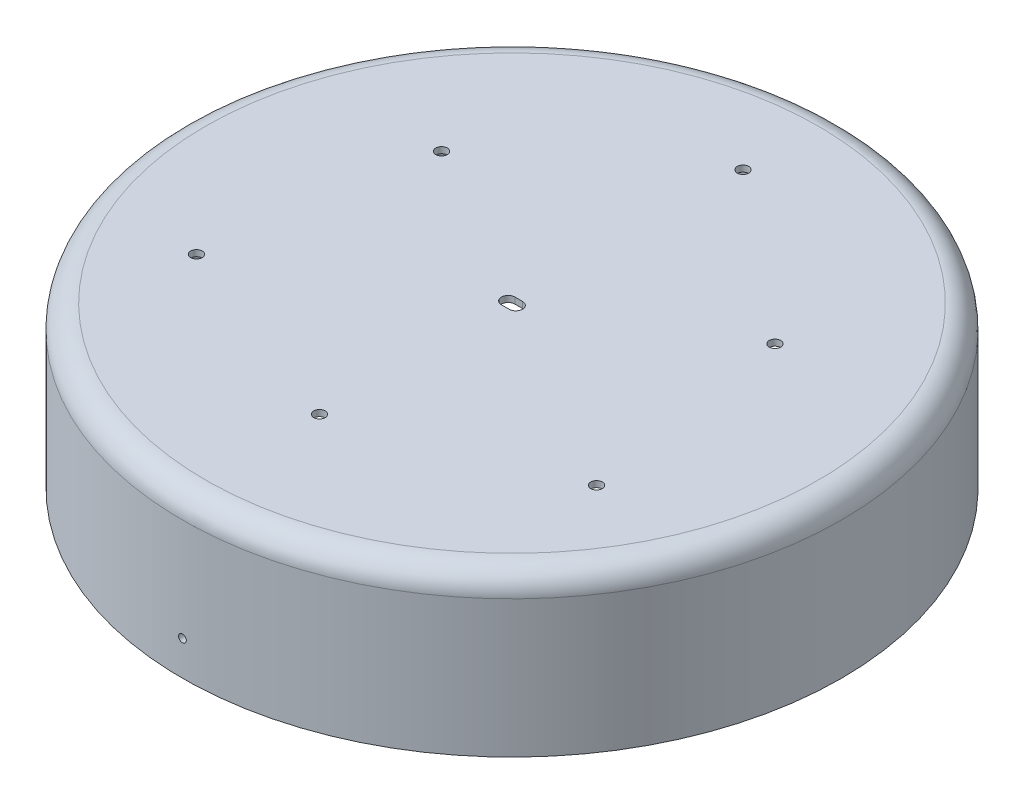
ISO-10303-21;
HEADER;
FILE_DESCRIPTION(('STEP AP214'),'2;1');
FILE_NAME('part.step','',(''),(''),'','','');
FILE_SCHEMA(('AUTOMOTIVE_DESIGN { 1 0 10303 214 1 1 1 1 }'));
ENDSEC;
DATA;
#1=APPLICATION_CONTEXT('core data for automotive mechanical design processes');
#2=APPLICATION_PROTOCOL_DEFINITION('international standard','automotive_design',2000,#1);
#3=PRODUCT_CONTEXT('',#1,'mechanical');
#4=PRODUCT('Part','Part','',(#3));
#5=PRODUCT_RELATED_PRODUCT_CATEGORY('part','',(#4));
#6=PRODUCT_DEFINITION_FORMATION('','',#4);
#7=PRODUCT_DEFINITION_CONTEXT('part definition',#1,'design');
#8=PRODUCT_DEFINITION('design','',#6,#7);
#9=PRODUCT_DEFINITION_SHAPE('','',#8);
#10=(LENGTH_UNIT() NAMED_UNIT(*) SI_UNIT(.MILLI.,.METRE.));
#11=(NAMED_UNIT(*) PLANE_ANGLE_UNIT() SI_UNIT($,.RADIAN.));
#12=(NAMED_UNIT(*) SI_UNIT($,.STERADIAN.) SOLID_ANGLE_UNIT());
#13=UNCERTAINTY_MEASURE_WITH_UNIT(LENGTH_MEASURE(1.E-05),#10,'distance_accuracy_value','');
#14=(GEOMETRIC_REPRESENTATION_CONTEXT(3) GLOBAL_UNCERTAINTY_ASSIGNED_CONTEXT((#13)) GLOBAL_UNIT_ASSIGNED_CONTEXT((#10,
#11,#12)) REPRESENTATION_CONTEXT('',''));
#15=CARTESIAN_POINT('',(0.,0.,0.));
#16=DIRECTION('',(0.,0.,1.));
#17=DIRECTION('',(1.,0.,0.));
#18=AXIS2_PLACEMENT_3D('',#15,#16,#17);
#19=CARTESIAN_POINT('',(0.,41.6,0.));
#20=DIRECTION('',(0.,1.,0.));
#21=DIRECTION('',(-1.,0.,0.));
#22=AXIS2_PLACEMENT_3D('',#19,#20,#21);
#23=PLANE('',#22);
#24=CARTESIAN_POINT('',(0.,41.6,-60.));
#25=DIRECTION('',(0.,1.,0.));
#26=DIRECTION('',(-1.,0.,0.));
#27=AXIS2_PLACEMENT_3D('',#24,#25,#26);
#28=CIRCLE('',#27,1.5);
#29=CARTESIAN_POINT('',(-1.5,41.6,-60.));
#30=VERTEX_POINT('',#29);
#31=EDGE_CURVE('E179',#30,#30,#28,.T.);
#32=ORIENTED_EDGE('',*,*,#31,.F.);
#33=EDGE_LOOP('',(#32));
#34=FACE_BOUND('',#33,.T.);
#35=CARTESIAN_POINT('',(-43.3012701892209,41.6,-24.9999999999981));
#36=DIRECTION('',(0.,1.,0.));
#37=DIRECTION('',(-1.,0.,0.));
#38=AXIS2_PLACEMENT_3D('',#35,#36,#37);
#39=CIRCLE('',#38,1.50000000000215);
#40=CARTESIAN_POINT('',(-44.801270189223,41.6,-24.9999999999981));
#41=VERTEX_POINT('',#40);
#42=EDGE_CURVE('E100',#41,#41,#39,.T.);
#43=ORIENTED_EDGE('',*,*,#42,.F.);
#44=EDGE_LOOP('',(#43));
#45=FACE_BOUND('',#44,.T.);
#46=CARTESIAN_POINT('',(4.25081524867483E-12,41.6,50.));
#47=DIRECTION('',(0.,1.,0.));
#48=DIRECTION('',(-1.,0.,0.));
#49=AXIS2_PLACEMENT_3D('',#46,#47,#48);
#50=CIRCLE('',#49,1.5000000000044);
#51=CARTESIAN_POINT('',(-1.50000000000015,41.6,50.));
#52=VERTEX_POINT('',#51);
#53=EDGE_CURVE('E189',#52,#52,#50,.T.);
#54=ORIENTED_EDGE('',*,*,#53,.F.);
#55=EDGE_LOOP('',(#54));
#56=FACE_BOUND('',#55,.T.);
#57=CARTESIAN_POINT('',(43.301270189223,41.6,-25.0000000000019));
#58=DIRECTION('',(0.,1.,0.));
#59=DIRECTION('',(-1.,0.,0.));
#60=AXIS2_PLACEMENT_3D('',#57,#58,#59);
#61=CIRCLE('',#60,1.5000000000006);
#62=CARTESIAN_POINT('',(41.8012701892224,41.6,-25.0000000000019));
#63=VERTEX_POINT('',#62);
#64=EDGE_CURVE('E192',#63,#63,#61,.T.);
#65=ORIENTED_EDGE('',*,*,#64,.F.);
#66=EDGE_LOOP('',(#65));
#67=FACE_BOUND('',#66,.T.);
#68=CARTESIAN_POINT('',(-1.,41.6,0.));
#69=DIRECTION('',(0.,1.,0.));
#70=DIRECTION('',(-1.,0.,0.));
#71=AXIS2_PLACEMENT_3D('',#68,#69,#70);
#72=CIRCLE('',#71,1.75);
#73=CARTESIAN_POINT('',(-1.,41.6,-1.75));
#74=VERTEX_POINT('',#73);
#75=CARTESIAN_POINT('',(-1.,41.6,1.75));
#76=VERTEX_POINT('',#75);
#77=EDGE_CURVE('E201',#74,#76,#72,.T.);
#78=ORIENTED_EDGE('',*,*,#77,.F.);
#79=DIRECTION('',(-1.,0.,0.));
#80=VECTOR('',#79,1.);
#81=CARTESIAN_POINT('',(-1.,41.6,-1.75));
#82=LINE('',#81,#80);
#83=CARTESIAN_POINT('',(0.999999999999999,41.6,-1.75));
#84=VERTEX_POINT('',#83);
#85=EDGE_CURVE('E209',#84,#74,#82,.T.);
#86=ORIENTED_EDGE('',*,*,#85,.F.);
#87=CARTESIAN_POINT('',(1.,41.6,0.));
#88=DIRECTION('',(0.,1.,0.));
#89=DIRECTION('',(-1.,0.,0.));
#90=AXIS2_PLACEMENT_3D('',#87,#88,#89);
#91=CIRCLE('',#90,1.75);
#92=CARTESIAN_POINT('',(1.,41.6,1.75));
#93=VERTEX_POINT('',#92);
#94=EDGE_CURVE('E206',#93,#84,#91,.T.);
#95=ORIENTED_EDGE('',*,*,#94,.F.);
#96=DIRECTION('',(1.,0.,0.));
#97=VECTOR('',#96,1.);
#98=CARTESIAN_POINT('',(-1.,41.6,1.75));
#99=LINE('',#98,#97);
#100=EDGE_CURVE('E203',#76,#93,#99,.T.);
#101=ORIENTED_EDGE('',*,*,#100,.F.);
#102=EDGE_LOOP('',(#78,#86,#95,#101));
#103=FACE_BOUND('',#102,.T.);
#104=CARTESIAN_POINT('',(-51.9615242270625,41.6,30.0000000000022));
#105=DIRECTION('',(0.,1.,0.));
#106=DIRECTION('',(-1.,0.,0.));
#107=AXIS2_PLACEMENT_3D('',#104,#105,#106);
#108=CIRCLE('',#107,1.5);
#109=CARTESIAN_POINT('',(-53.4615242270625,41.6,30.0000000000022));
#110=VERTEX_POINT('',#109);
#111=EDGE_CURVE('E197',#110,#110,#108,.T.);
#112=ORIENTED_EDGE('',*,*,#111,.F.);
#113=EDGE_LOOP('',(#112));
#114=FACE_BOUND('',#113,.T.);
#115=CARTESIAN_POINT('',(51.9615242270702,41.6,29.9999999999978));
#116=DIRECTION('',(0.,1.,0.));
#117=DIRECTION('',(-1.,0.,0.));
#118=AXIS2_PLACEMENT_3D('',#115,#116,#117);
#119=CIRCLE('',#118,1.50000000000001);
#120=CARTESIAN_POINT('',(50.4615242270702,41.6,29.9999999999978));
#121=VERTEX_POINT('',#120);
#122=EDGE_CURVE('E188',#121,#121,#119,.T.);
#123=ORIENTED_EDGE('',*,*,#122,.F.);
#124=EDGE_LOOP('',(#123));
#125=FACE_BOUND('',#124,.T.);
#126=CARTESIAN_POINT('',(0.,41.6,0.));
#127=DIRECTION('',(0.,1.,0.));
#128=DIRECTION('',(-1.,0.,0.));
#129=AXIS2_PLACEMENT_3D('',#126,#127,#128);
#130=CIRCLE('',#129,79.6);
#131=CARTESIAN_POINT('',(-79.6,41.6,0.));
#132=VERTEX_POINT('',#131);
#133=EDGE_CURVE('E238',#132,#132,#130,.T.);
#134=ORIENTED_EDGE('',*,*,#133,.T.);
#135=EDGE_LOOP('',(#134));
#136=FACE_BOUND('',#135,.T.);
#137=ADVANCED_FACE('F36',(#34,#45,#56,#67,#103,#114,#125,#136),#23,.T.);
#138=CARTESIAN_POINT('',(0.,35.6,0.));
#139=DIRECTION('',(0.,1.,0.));
#140=DIRECTION('',(-1.,0.,0.));
#141=AXIS2_PLACEMENT_3D('',#138,#139,#140);
#142=TOROIDAL_SURFACE('',#141,79.6,6.);
#143=CARTESIAN_POINT('',(0.,35.6,0.));
#144=DIRECTION('',(0.,1.,0.));
#145=DIRECTION('',(-1.,0.,0.));
#146=AXIS2_PLACEMENT_3D('',#143,#144,#145);
#147=CIRCLE('',#146,85.6);
#148=CARTESIAN_POINT('',(-85.6,35.6,0.));
#149=VERTEX_POINT('',#148);
#150=EDGE_CURVE('E235',#149,#149,#147,.T.);
#151=ORIENTED_EDGE('',*,*,#150,.T.);
#152=EDGE_LOOP('',(#151));
#153=FACE_BOUND('',#152,.T.);
#154=ORIENTED_EDGE('',*,*,#133,.F.);
#155=EDGE_LOOP('',(#154));
#156=FACE_BOUND('',#155,.T.);
#157=ADVANCED_FACE('F114',(#153,#156),#142,.T.);
#158=CARTESIAN_POINT('',(0.,50.6009457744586,0.));
#159=DIRECTION('',(0.,1.,0.));
#160=DIRECTION('',(-1.,0.,0.));
#161=AXIS2_PLACEMENT_3D('',#158,#159,#160);
#162=CYLINDRICAL_SURFACE('',#161,85.6);
#163=CARTESIAN_POINT('',(9.28043879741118E-13,8.,-85.6));
#164=CARTESIAN_POINT('',(0.0171113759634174,7.99999936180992,-85.6000000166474));
#165=CARTESIAN_POINT('',(0.0342246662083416,8.00037481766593,-85.5999948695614));
#166=CARTESIAN_POINT('',(0.0681341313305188,8.00190209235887,-85.599974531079));
#167=CARTESIAN_POINT('',(0.0849308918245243,8.00304103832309,-85.5999595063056));
#168=CARTESIAN_POINT('',(0.118207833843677,8.00609486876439,-85.5999199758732));
#169=CARTESIAN_POINT('',(0.134689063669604,8.00799821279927,-85.5998956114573));
#170=CARTESIAN_POINT('',(0.167334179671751,8.01257920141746,-85.5998379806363));
#171=CARTESIAN_POINT('',(0.183499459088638,8.0152468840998,-85.599804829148));
#172=CARTESIAN_POINT('',(0.215512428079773,8.02135493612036,-85.5997301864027));
#173=CARTESIAN_POINT('',(0.231361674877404,8.02478712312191,-85.5996887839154));
#174=CARTESIAN_POINT('',(0.262742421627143,8.03242230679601,-85.599598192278));
#175=CARTESIAN_POINT('',(0.278275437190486,8.03661906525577,-85.5995490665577));
#176=CARTESIAN_POINT('',(0.309023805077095,8.04578138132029,-85.5994435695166));
#177=CARTESIAN_POINT('',(0.324240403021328,8.05074275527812,-85.5993872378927));
#178=CARTESIAN_POINT('',(0.354356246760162,8.06143219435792,-85.5992678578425));
#179=CARTESIAN_POINT('',(0.369256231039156,8.06715817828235,-85.5992048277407));
#180=CARTESIAN_POINT('',(0.398739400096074,8.07937470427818,-85.599072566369));
#181=CARTESIAN_POINT('',(0.41332258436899,8.08586524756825,-85.5990033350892));
#182=CARTESIAN_POINT('',(0.442172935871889,8.09960880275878,-85.5988591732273));
#183=CARTESIAN_POINT('',(0.456439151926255,8.10686381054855,-85.5987842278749));
#184=CARTESIAN_POINT('',(0.484656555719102,8.12213431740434,-85.5986291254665));
#185=CARTESIAN_POINT('',(0.498605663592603,8.1301536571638,-85.5985489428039));
#186=CARTESIAN_POINT('',(0.5261900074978,8.14695102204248,-85.5983838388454));
#187=CARTESIAN_POINT('',(0.539821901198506,8.15573453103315,-85.5982988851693));
#188=CARTESIAN_POINT('',(0.566773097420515,8.17405865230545,-85.5981246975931));
#189=CARTESIAN_POINT('',(0.58008771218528,8.18360615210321,-85.5980354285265));
#190=CARTESIAN_POINT('',(0.606405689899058,8.20345691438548,-85.5978530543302));
#191=CARTESIAN_POINT('',(0.619402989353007,8.21376820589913,-85.5977599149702));
#192=CARTESIAN_POINT('',(0.64508773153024,8.23514552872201,-85.5975702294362));
#193=CARTESIAN_POINT('',(0.657767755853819,8.24622046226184,-85.5974736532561));
#194=CARTESIAN_POINT('',(0.682819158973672,8.26912414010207,-85.5972775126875));
#195=CARTESIAN_POINT('',(0.695181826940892,8.28096239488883,-85.5971779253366));
#196=CARTESIAN_POINT('',(0.719374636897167,8.30516702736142,-85.5969780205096));
#197=CARTESIAN_POINT('',(0.731204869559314,8.31753331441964,-85.5968777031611));
#198=CARTESIAN_POINT('',(0.754092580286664,8.34259149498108,-85.5966791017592));
#199=CARTESIAN_POINT('',(0.765159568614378,8.35527468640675,-85.5965808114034));
#200=CARTESIAN_POINT('',(0.786521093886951,8.3809652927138,-85.5963871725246));
#201=CARTESIAN_POINT('',(0.79682453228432,8.39396529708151,-85.5962918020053));
#202=CARTESIAN_POINT('',(0.816659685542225,8.42028821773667,-85.5961048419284));
#203=CARTESIAN_POINT('',(0.826199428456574,8.43360507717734,-85.5960132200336));
#204=CARTESIAN_POINT('',(0.844508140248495,8.46056029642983,-85.5958345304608));
#205=CARTESIAN_POINT('',(0.853283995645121,8.47419397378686,-85.5957474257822));
#206=CARTESIAN_POINT('',(0.870066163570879,8.50178142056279,-85.5955784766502));
#207=CARTESIAN_POINT('',(0.878077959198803,8.51573185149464,-85.5954965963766));
#208=CARTESIAN_POINT('',(0.893333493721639,8.54395143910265,-85.5953387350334));
#209=CARTESIAN_POINT('',(0.900581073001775,8.55821851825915,-85.5952627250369));
#210=CARTESIAN_POINT('',(0.914309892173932,8.58707013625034,-85.5951171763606));
#211=CARTESIAN_POINT('',(0.920793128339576,8.60165372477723,-85.5950476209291));
#212=CARTESIAN_POINT('',(0.932995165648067,8.63113724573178,-85.5949154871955));
#213=CARTESIAN_POINT('',(0.938713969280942,8.64603717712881,-85.5948529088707));
#214=CARTESIAN_POINT('',(0.949389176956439,8.67615246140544,-85.5947351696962));
#215=CARTESIAN_POINT('',(0.954343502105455,8.69136855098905,-85.5946800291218));
#216=CARTESIAN_POINT('',(0.963491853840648,8.72211545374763,-85.594577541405));
#217=CARTESIAN_POINT('',(0.967681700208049,8.73764750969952,-85.5945302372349));
#218=CARTESIAN_POINT('',(0.975303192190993,8.76902588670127,-85.5944437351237));
#219=CARTESIAN_POINT('',(0.978728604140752,8.78487371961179,-85.5944046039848));
#220=CARTESIAN_POINT('',(0.984823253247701,8.81688343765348,-85.5943346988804));
#221=CARTESIAN_POINT('',(0.987484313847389,8.83304687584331,-85.5943040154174));
#222=CARTESIAN_POINT('',(0.992052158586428,8.86568780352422,-85.5942511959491));
#223=CARTESIAN_POINT('',(0.993948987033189,8.88216668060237,-85.5942291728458));
#224=CARTESIAN_POINT('',(0.9969900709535,8.91543874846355,-85.5941938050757));
#225=CARTESIAN_POINT('',(0.998122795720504,8.93223298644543,-85.5941805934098));
#226=CARTESIAN_POINT('',(0.999637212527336,8.96613597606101,-85.5941629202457));
#227=CARTESIAN_POINT('',(1.00000603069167,8.98324529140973,-85.594158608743));
#228=CARTESIAN_POINT('',(0.999993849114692,9.01744833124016,-85.5941587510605));
#229=CARTESIAN_POINT('',(0.999613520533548,9.0345420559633,-85.5941631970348));
#230=CARTESIAN_POINT('',(0.998077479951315,9.0684140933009,-85.5941811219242));
#231=CARTESIAN_POINT('',(0.996934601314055,9.08519297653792,-85.594194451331));
#232=CARTESIAN_POINT('',(0.993874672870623,9.11843456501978,-85.5942300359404));
#233=CARTESIAN_POINT('',(0.991969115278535,9.13489832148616,-85.5942521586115));
#234=CARTESIAN_POINT('',(0.987385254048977,9.16750924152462,-85.5943051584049));
#235=CARTESIAN_POINT('',(0.984716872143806,9.18365779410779,-85.5943359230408));
#236=CARTESIAN_POINT('',(0.978609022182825,9.21563797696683,-85.5944059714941));
#237=CARTESIAN_POINT('',(0.975177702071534,9.23147115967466,-85.5944451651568));
#238=CARTESIAN_POINT('',(0.96754582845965,9.26282047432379,-85.5945317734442));
#239=CARTESIAN_POINT('',(0.963351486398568,9.27833811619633,-85.5945791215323));
#240=CARTESIAN_POINT('',(0.954195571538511,9.30905643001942,-85.5946816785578));
#241=CARTESIAN_POINT('',(0.94923816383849,9.32425834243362,-85.5947368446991));
#242=CARTESIAN_POINT('',(0.938558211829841,9.35434551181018,-85.5948546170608));
#243=CARTESIAN_POINT('',(0.932837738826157,9.3692315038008,-85.594917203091));
#244=CARTESIAN_POINT('',(0.920633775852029,9.39868738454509,-85.5950493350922));
#245=CARTESIAN_POINT('',(0.914150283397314,9.4132572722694,-85.595118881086));
#246=CARTESIAN_POINT('',(0.900422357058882,9.44208172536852,-85.595264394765));
#247=CARTESIAN_POINT('',(0.893175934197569,9.45633534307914,-85.5953403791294));
#248=CARTESIAN_POINT('',(0.877924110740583,9.48452824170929,-85.5954981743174));
#249=CARTESIAN_POINT('',(0.869914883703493,9.4984654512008,-85.5955800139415));
#250=CARTESIAN_POINT('',(0.853139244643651,9.52602668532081,-85.5957488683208));
#251=CARTESIAN_POINT('',(0.844367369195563,9.53964738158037,-85.5958359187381));
#252=CARTESIAN_POINT('',(0.82606800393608,9.56657686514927,-85.59601448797));
#253=CARTESIAN_POINT('',(0.816533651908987,9.57988098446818,-85.5961060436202));
#254=CARTESIAN_POINT('',(0.796710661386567,9.60617864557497,-85.5962928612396));
#255=CARTESIAN_POINT('',(0.786414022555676,9.61916614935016,-85.5963881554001));
#256=CARTESIAN_POINT('',(0.765067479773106,9.64483197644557,-85.5965816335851));
#257=CARTESIAN_POINT('',(0.754008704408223,9.6575029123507,-85.5966798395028));
#258=CARTESIAN_POINT('',(0.731138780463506,9.68253677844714,-85.5968782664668));
#259=CARTESIAN_POINT('',(0.719318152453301,9.69489103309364,-85.5969784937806));
#260=CARTESIAN_POINT('',(0.695135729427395,9.71908216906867,-85.5971782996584));
#261=CARTESIAN_POINT('',(0.682773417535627,9.7309185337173,-85.597277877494));
#262=CARTESIAN_POINT('',(0.657722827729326,9.75381857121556,-85.5974739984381));
#263=CARTESIAN_POINT('',(0.645043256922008,9.76489175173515,-85.5975705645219));
#264=CARTESIAN_POINT('',(0.619359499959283,9.78626568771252,-85.5977602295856));
#265=CARTESIAN_POINT('',(0.606362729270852,9.79657534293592,-85.5978533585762));
#266=CARTESIAN_POINT('',(0.580045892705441,9.8164229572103,-85.598035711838));
#267=CARTESIAN_POINT('',(0.566731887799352,9.82596894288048,-85.5981249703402));
#268=CARTESIAN_POINT('',(0.539781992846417,9.84429015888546,-85.5982991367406));
#269=CARTESIAN_POINT('',(0.526150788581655,9.85307227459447,-85.5983840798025));
#270=CARTESIAN_POINT('',(0.49856790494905,9.86986697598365,-85.598549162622));
#271=CARTESIAN_POINT('',(0.48461956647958,9.87788504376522,-85.598629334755));
#272=CARTESIAN_POINT('',(0.456403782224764,9.8931531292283,-85.5987844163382));
#273=CARTESIAN_POINT('',(0.442138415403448,9.90040698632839,-85.5988593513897));
#274=CARTESIAN_POINT('',(0.413289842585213,9.91414836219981,-85.5990034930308));
#275=CARTESIAN_POINT('',(0.398707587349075,9.92063787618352,-85.599072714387));
#276=CARTESIAN_POINT('',(0.369226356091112,9.9328524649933,-85.5992049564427));
#277=CARTESIAN_POINT('',(0.354327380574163,9.93857754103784,-85.599267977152));
#278=CARTESIAN_POINT('',(0.324213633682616,9.94926528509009,-85.599387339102));
#279=CARTESIAN_POINT('',(0.308998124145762,9.95422587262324,-85.5994436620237));
#280=CARTESIAN_POINT('',(0.278252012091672,9.96338673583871,-85.5995491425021));
#281=CARTESIAN_POINT('',(0.26272016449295,9.96758282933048,-85.5995982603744));
#282=CARTESIAN_POINT('',(0.231341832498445,9.97521680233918,-85.5996888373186));
#283=CARTESIAN_POINT('',(0.215493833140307,9.97864844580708,-85.5997302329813));
#284=CARTESIAN_POINT('',(0.183483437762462,9.9847555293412,-85.5998048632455));
#285=CARTESIAN_POINT('',(0.167319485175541,9.98742278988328,-85.5998380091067));
#286=CARTESIAN_POINT('',(0.134677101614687,9.99200305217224,-85.5998956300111));
#287=CARTESIAN_POINT('',(0.11819727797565,9.99390609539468,-85.5999199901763));
#288=CARTESIAN_POINT('',(0.0849232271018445,9.99695944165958,-85.5999595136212));
#289=CARTESIAN_POINT('',(0.0681279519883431,9.99809820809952,-85.5999745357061));
#290=CARTESIAN_POINT('',(0.0342215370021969,9.9996252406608,-85.5999948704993));
#291=CARTESIAN_POINT('',(0.0171098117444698,10.0000006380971,-85.6000000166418));
#292=CARTESIAN_POINT('',(0.,10.,-85.6));
#293=B_SPLINE_CURVE_WITH_KNOTS('',3,(#163,#164,#165,#166,#167,#168,#169,#170,#171,#172,#173,
#174,#175,#176,#177,#178,#179,#180,#181,#182,#183,#184,#185,#186,#187,#188,#189,#190,#191,#192,
#193,#194,#195,#196,#197,#198,#199,#200,#201,#202,#203,#204,#205,#206,#207,#208,#209,#210,#211,
#212,#213,#214,#215,#216,#217,#218,#219,#220,#221,#222,#223,#224,#225,#226,#227,#228,#229,#230,
#231,#232,#233,#234,#235,#236,#237,#238,#239,#240,#241,#242,#243,#244,#245,#246,#247,#248,#249,
#250,#251,#252,#253,#254,#255,#256,#257,#258,#259,#260,#261,#262,#263,#264,#265,#266,#267,#268,
#269,#270,#271,#272,#273,#274,#275,#276,#277,#278,#279,#280,#281,#282,#283,#284,#285,#286,#287,
#288,#289,#290,#291,#292),.UNSPECIFIED.,.F.,.F.,(4,2,2,2,2,2,2,2,2,2,2,2,2,2,2,2,2,2,2,2,2,2,2,
2,2,2,2,2,2,2,2,2,2,2,2,2,2,2,2,2,2,2,2,2,2,2,2,2,2,2,2,2,2,2,2,2,2,2,2,2,2,2,2,2,4),(0.,
0.0513327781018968,0.101821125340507,0.151574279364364,0.200706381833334,0.249335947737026,
0.29758519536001,0.345579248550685,0.393445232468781,0.44131129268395,0.489305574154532,
0.53755520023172,0.586185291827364,0.635318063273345,0.685072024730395,0.735561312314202,
0.78689515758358,0.838220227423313,0.888701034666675,0.938446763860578,0.987571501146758,
1.03619370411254,1.08443553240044,1.13242205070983,1.18028032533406,1.22813844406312,
1.27612449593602,1.32436555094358,1.37298667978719,1.4221100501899,1.47185412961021,
1.52233301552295,1.57365590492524,1.62493283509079,1.67536786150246,1.72506992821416,
1.77415286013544,1.82273483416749,1.8709377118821,1.91888624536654,1.96670717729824,
2.0145282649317,2.06247726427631,2.11068091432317,2.15926396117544,2.20834825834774,
2.25805197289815,2.30848891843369,2.35976802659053,2.41109717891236,2.46158198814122,
2.51133165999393,2.56046030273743,2.60908639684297,2.65733212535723,2.70532257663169,
2.75318484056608,2.8010470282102,2.8490372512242,2.89728260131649,2.94590816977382,
2.995036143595,3.04478500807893,3.09526887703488,3.14659696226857),.UNSPECIFIED.);
#294=CARTESIAN_POINT('',(0.,8.,-85.6));
#295=VERTEX_POINT('',#294);
#296=CARTESIAN_POINT('',(0.,10.,-85.6));
#297=VERTEX_POINT('',#296);
#298=EDGE_CURVE('E53',#295,#297,#293,.T.);
#299=ORIENTED_EDGE('',*,*,#298,.T.);
#300=CARTESIAN_POINT('',(0.,10.,-85.6));
#301=CARTESIAN_POINT('',(-0.0171224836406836,10.0000006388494,-85.6000000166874));
#302=CARTESIAN_POINT('',(-0.0342468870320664,9.99962476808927,-85.5999948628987));
#303=CARTESIAN_POINT('',(-0.0681780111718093,9.99809577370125,-85.5999744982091));
#304=CARTESIAN_POINT('',(-0.0849853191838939,9.99695555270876,-85.599959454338));
#305=CARTESIAN_POINT('',(-0.118282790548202,9.9938982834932,-85.5999198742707));
#306=CARTESIAN_POINT('',(-0.134774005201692,9.99199280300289,-85.5998954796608));
#307=CARTESIAN_POINT('',(-0.167438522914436,9.98740665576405,-85.5998377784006));
#308=CARTESIAN_POINT('',(-0.183613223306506,9.98473597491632,-85.5998045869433));
#309=CARTESIAN_POINT('',(-0.215644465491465,9.97862104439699,-85.5997298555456));
#310=CARTESIAN_POINT('',(-0.231502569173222,9.97518499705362,-85.5996884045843));
#311=CARTESIAN_POINT('',(-0.26290046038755,9.96754121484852,-85.5995977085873));
#312=CARTESIAN_POINT('',(-0.278441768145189,9.96333973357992,-85.5995485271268));
#313=CARTESIAN_POINT('',(-0.30920615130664,9.95416709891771,-85.5994429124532));
#314=CARTESIAN_POINT('',(-0.324430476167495,9.94920013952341,-85.5993865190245));
#315=CARTESIAN_POINT('',(-0.35456120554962,9.93849866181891,-85.5992670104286));
#316=CARTESIAN_POINT('',(-0.36946835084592,9.93276622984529,-85.599203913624));
#317=CARTESIAN_POINT('',(-0.398965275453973,9.9205359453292,-85.5990715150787));
#318=CARTESIAN_POINT('',(-0.413555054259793,9.91403809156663,-85.5990022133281));
#319=CARTESIAN_POINT('',(-0.442418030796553,9.90027905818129,-85.5988579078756));
#320=CARTESIAN_POINT('',(-0.456690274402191,9.89301587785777,-85.5987828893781));
#321=CARTESIAN_POINT('',(-0.484919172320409,9.87772817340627,-85.5986276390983));
#322=CARTESIAN_POINT('',(-0.498873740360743,9.86969979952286,-85.5985473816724));
#323=CARTESIAN_POINT('',(-0.526468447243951,9.85288351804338,-85.5983821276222));
#324=CARTESIAN_POINT('',(-0.540105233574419,9.84409011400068,-85.5982970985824));
#325=CARTESIAN_POINT('',(-0.567065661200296,9.8257453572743,-85.5981227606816));
#326=CARTESIAN_POINT('',(-0.580384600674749,9.81618710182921,-85.598033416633));
#327=CARTESIAN_POINT('',(-0.606710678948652,9.7963139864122,-85.5978508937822));
#328=CARTESIAN_POINT('',(-0.619711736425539,9.78599108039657,-85.5977576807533));
#329=CARTESIAN_POINT('',(-0.645403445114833,9.76458968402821,-85.5975678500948));
#330=CARTESIAN_POINT('',(-0.658086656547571,9.75350227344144,-85.5974712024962));
#331=CARTESIAN_POINT('',(-0.683143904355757,9.73057281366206,-85.5972749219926));
#332=CARTESIAN_POINT('',(-0.695509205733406,9.7187212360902,-85.5971752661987));
#333=CARTESIAN_POINT('',(-0.719698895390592,9.69449708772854,-85.5969752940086));
#334=CARTESIAN_POINT('',(-0.731523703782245,9.68212493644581,-85.5968749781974));
#335=CARTESIAN_POINT('',(-0.754400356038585,9.65705536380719,-85.5966763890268));
#336=CARTESIAN_POINT('',(-0.765461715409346,9.64436664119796,-85.596578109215));
#337=CARTESIAN_POINT('',(-0.786811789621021,9.6186653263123,-85.5963845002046));
#338=CARTESIAN_POINT('',(-0.797109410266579,9.60566014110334,-85.5962891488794));
#339=CARTESIAN_POINT('',(-0.81693273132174,9.5793272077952,-85.596102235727));
#340=CARTESIAN_POINT('',(-0.826466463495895,9.5660055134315,-85.5960106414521));
#341=CARTESIAN_POINT('',(-0.844762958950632,9.53904097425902,-85.5958320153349));
#342=CARTESIAN_POINT('',(-0.853532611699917,9.52540280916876,-85.5957449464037));
#343=CARTESIAN_POINT('',(-0.87030217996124,9.49780673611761,-85.5955760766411));
#344=CARTESIAN_POINT('',(-0.878307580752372,9.48385216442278,-85.5954942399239));
#345=CARTESIAN_POINT('',(-0.893550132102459,9.45562464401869,-85.5953364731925));
#346=CARTESIAN_POINT('',(-0.900791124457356,9.44135377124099,-85.5952605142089));
#347=CARTESIAN_POINT('',(-0.914506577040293,9.41249491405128,-85.5951150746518));
#348=CARTESIAN_POINT('',(-0.920983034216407,9.39790787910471,-85.5950455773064));
#349=CARTESIAN_POINT('',(-0.933171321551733,9.36841781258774,-85.5949135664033));
#350=CARTESIAN_POINT('',(-0.938883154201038,9.3535147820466,-85.5948510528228));
#351=CARTESIAN_POINT('',(-0.949544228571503,9.32339364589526,-85.5947334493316));
#352=CARTESIAN_POINT('',(-0.954491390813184,9.30817480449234,-85.5946783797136));
#353=CARTESIAN_POINT('',(-0.96362522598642,9.27742274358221,-85.5945760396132));
#354=CARTESIAN_POINT('',(-0.967807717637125,9.26188828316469,-85.5945288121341));
#355=CARTESIAN_POINT('',(-0.975414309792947,9.2305054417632,-85.5944424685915));
#356=CARTESIAN_POINT('',(-0.97883217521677,9.21465555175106,-85.5944034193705));
#357=CARTESIAN_POINT('',(-0.984911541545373,9.18264206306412,-85.5943336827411));
#358=CARTESIAN_POINT('',(-0.987564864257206,9.166476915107,-85.5943030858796));
#359=CARTESIAN_POINT('',(-0.992117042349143,9.13383291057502,-85.5942504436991));
#360=CARTESIAN_POINT('',(-0.994005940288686,9.11735267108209,-85.5942285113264));
#361=CARTESIAN_POINT('',(-0.997030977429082,9.08407822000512,-85.5941933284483));
#362=CARTESIAN_POINT('',(-0.998155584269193,9.06728296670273,-85.5941802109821));
#363=CARTESIAN_POINT('',(-0.999653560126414,9.03337828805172,-85.5941627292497));
#364=CARTESIAN_POINT('',(-1.00001405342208,9.01626830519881,-85.5941585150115));
#365=CARTESIAN_POINT('',(-0.999985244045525,8.9820553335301,-85.5941588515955));
#366=CARTESIAN_POINT('',(-0.999596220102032,8.96495234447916,-85.5941633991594));
#367=CARTESIAN_POINT('',(-0.998042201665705,8.93106263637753,-85.5941815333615));
#368=CARTESIAN_POINT('',(-0.996890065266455,8.91427533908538,-85.5941949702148));
#369=CARTESIAN_POINT('',(-0.993811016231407,8.88101778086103,-85.5942307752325));
#370=CARTESIAN_POINT('',(-0.991895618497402,8.86454646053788,-85.594253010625));
#371=CARTESIAN_POINT('',(-0.98729147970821,8.83192127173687,-85.594306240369));
#372=CARTESIAN_POINT('',(-0.984612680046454,8.81576600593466,-85.5943371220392));
#373=CARTESIAN_POINT('',(-0.978483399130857,8.78377325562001,-85.5944074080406));
#374=CARTESIAN_POINT('',(-0.975041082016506,8.76793421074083,-85.5944467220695));
#375=CARTESIAN_POINT('',(-0.967386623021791,8.73657403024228,-85.5945335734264));
#376=CARTESIAN_POINT('',(-0.963180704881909,8.72105137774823,-85.5945810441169));
#377=CARTESIAN_POINT('',(-0.954001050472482,8.69032390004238,-85.5946838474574));
#378=CARTESIAN_POINT('',(-0.949031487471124,8.67511782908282,-85.5947391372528));
#379=CARTESIAN_POINT('',(-0.938326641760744,8.64502319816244,-85.5948571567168));
#380=CARTESIAN_POINT('',(-0.932593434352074,8.63013390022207,-85.5949198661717));
#381=CARTESIAN_POINT('',(-0.920363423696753,8.60067226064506,-85.5950522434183));
#382=CARTESIAN_POINT('',(-0.91386661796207,8.58609992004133,-85.5951219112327));
#383=CARTESIAN_POINT('',(-0.900111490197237,8.55727141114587,-85.5952676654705));
#384=CARTESIAN_POINT('',(-0.892851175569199,8.54301619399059,-85.5953437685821));
#385=CARTESIAN_POINT('',(-0.877570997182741,8.514820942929,-85.5955017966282));
#386=CARTESIAN_POINT('',(-0.869547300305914,8.50088298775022,-85.5955837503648));
#387=CARTESIAN_POINT('',(-0.852742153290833,8.47332110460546,-85.5957528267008));
#388=CARTESIAN_POINT('',(-0.843955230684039,8.45970051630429,-85.5958399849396));
#389=CARTESIAN_POINT('',(-0.825625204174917,8.43277208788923,-85.5960187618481));
#390=CARTESIAN_POINT('',(-0.816075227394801,8.41946893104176,-85.5961104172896));
#391=CARTESIAN_POINT('',(-0.796220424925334,8.39317402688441,-85.596297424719));
#392=CARTESIAN_POINT('',(-0.785907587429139,8.3801883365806,-85.5963928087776));
#393=CARTESIAN_POINT('',(-0.764528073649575,8.35452697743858,-85.5965864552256));
#394=CARTESIAN_POINT('',(-0.753452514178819,8.34185871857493,-85.5966847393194));
#395=CARTESIAN_POINT('',(-0.730548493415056,8.31683099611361,-85.5968833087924));
#396=CARTESIAN_POINT('',(-0.718710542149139,8.30448023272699,-85.5969836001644));
#397=CARTESIAN_POINT('',(-0.694514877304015,8.2803187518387,-85.5971833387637));
#398=CARTESIAN_POINT('',(-0.68215759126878,8.26850760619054,-85.5972827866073));
#399=CARTESIAN_POINT('',(-0.657118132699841,8.24565638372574,-85.5974786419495));
#400=CARTESIAN_POINT('',(-0.644444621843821,8.23460683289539,-85.5975750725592));
#401=CARTESIAN_POINT('',(-0.618774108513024,8.21327848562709,-85.5977644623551));
#402=CARTESIAN_POINT('',(-0.605784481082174,8.20299082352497,-85.5978574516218));
#403=CARTESIAN_POINT('',(-0.579483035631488,8.18318553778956,-85.598039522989));
#404=CARTESIAN_POINT('',(-0.566177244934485,8.17365991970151,-85.5981286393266));
#405=CARTESIAN_POINT('',(-0.539244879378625,8.1553777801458,-85.598302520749));
#406=CARTESIAN_POINT('',(-0.525622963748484,8.14661440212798,-85.5983873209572));
#407=CARTESIAN_POINT('',(-0.498059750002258,8.129855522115,-85.5985521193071));
#408=CARTESIAN_POINT('',(-0.48412177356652,8.12185456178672,-85.598632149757));
#409=CARTESIAN_POINT('',(-0.455927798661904,8.10661904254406,-85.5987869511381));
#410=CARTESIAN_POINT('',(-0.441673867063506,8.09938066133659,-85.5988617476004));
#411=CARTESIAN_POINT('',(-0.412849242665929,8.08566859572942,-85.5990056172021));
#412=CARTESIAN_POINT('',(-0.398279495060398,8.07919292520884,-85.5990747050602));
#413=CARTESIAN_POINT('',(-0.368824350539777,8.06700439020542,-85.5992066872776));
#414=CARTESIAN_POINT('',(-0.353938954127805,8.06129152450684,-85.5992695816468));
#415=CARTESIAN_POINT('',(-0.323853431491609,8.05062657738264,-85.5993887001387));
#416=CARTESIAN_POINT('',(-0.308652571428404,8.04567656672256,-85.5994449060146));
#417=CARTESIAN_POINT('',(-0.277936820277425,8.03653524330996,-85.5995501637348));
#418=CARTESIAN_POINT('',(-0.262420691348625,8.03234809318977,-85.5995991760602));
#419=CARTESIAN_POINT('',(-0.231074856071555,8.02473040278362,-85.5996895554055));
#420=CARTESIAN_POINT('',(-0.21524364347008,8.02130606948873,-85.5997308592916));
#421=CARTESIAN_POINT('',(-0.183267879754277,8.01521201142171,-85.5998053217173));
#422=CARTESIAN_POINT('',(-0.167121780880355,8.01255042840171,-85.5998383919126));
#423=CARTESIAN_POINT('',(-0.134516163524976,8.00797993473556,-85.5998958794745));
#424=CARTESIAN_POINT('',(-0.118055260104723,8.00608093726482,-85.5999201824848));
#425=CARTESIAN_POINT('',(-0.0848201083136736,8.00303410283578,-85.5999596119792));
#426=CARTESIAN_POINT('',(-0.0680448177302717,8.00189775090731,-85.599974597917));
#427=CARTESIAN_POINT('',(-0.034179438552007,8.00037397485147,-85.5999948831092));
#428=CARTESIAN_POINT('',(-0.0170887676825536,7.99999936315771,-85.6000000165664));
#429=CARTESIAN_POINT('',(0.,8.,-85.6));
#430=B_SPLINE_CURVE_WITH_KNOTS('',3,(#300,#301,#302,#303,#304,#305,#306,#307,#308,#309,#310,
#311,#312,#313,#314,#315,#316,#317,#318,#319,#320,#321,#322,#323,#324,#325,#326,#327,#328,#329,
#330,#331,#332,#333,#334,#335,#336,#337,#338,#339,#340,#341,#342,#343,#344,#345,#346,#347,#348,
#349,#350,#351,#352,#353,#354,#355,#356,#357,#358,#359,#360,#361,#362,#363,#364,#365,#366,#367,
#368,#369,#370,#371,#372,#373,#374,#375,#376,#377,#378,#379,#380,#381,#382,#383,#384,#385,#386,
#387,#388,#389,#390,#391,#392,#393,#394,#395,#396,#397,#398,#399,#400,#401,#402,#403,#404,#405,
#406,#407,#408,#409,#410,#411,#412,#413,#414,#415,#416,#417,#418,#419,#420,#421,#422,#423,#424,
#425,#426,#427,#428,#429),.UNSPECIFIED.,.F.,.F.,(4,2,2,2,2,2,2,2,2,2,2,2,2,2,2,2,2,2,2,2,2,2,2,
2,2,2,2,2,2,2,2,2,2,2,2,2,2,2,2,2,2,2,2,2,2,2,2,2,2,2,2,2,2,2,2,2,2,2,2,2,2,2,2,2,4),(0.,
0.0513661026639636,0.101886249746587,0.151669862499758,0.200831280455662,0.249489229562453,
0.297766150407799,0.345787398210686,0.393680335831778,0.441573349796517,0.489594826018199,
0.537872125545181,0.586530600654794,0.635692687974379,0.685477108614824,0.735998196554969,
0.787365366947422,0.838691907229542,0.889174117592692,0.938921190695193,0.988047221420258,
1.03667067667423,1.08491372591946,1.13290144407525,1.1807609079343,1.22862021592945,
1.27660746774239,1.32484974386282,1.37347212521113,1.42259678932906,1.47234221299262,
1.52282250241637,1.57414686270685,1.62545214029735,1.67591421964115,1.7256422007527,
1.77475007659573,1.82335620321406,1.87158263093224,1.91955430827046,1.9673981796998,
2.01524220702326,2.06321435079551,2.11144155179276,2.16004875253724,2.20915799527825,
2.25888762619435,2.30935162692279,2.36065908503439,2.41192510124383,2.46234965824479,
2.51204161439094,2.56111470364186,2.60968700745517,2.65788028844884,2.70581919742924,
2.75363037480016,2.80144147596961,2.84938015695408,2.89757305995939,2.94614483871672,
2.99521725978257,3.04490840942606,3.09533202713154,3.14659697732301),.UNSPECIFIED.);
#431=EDGE_CURVE('E90',#297,#295,#430,.T.);
#432=ORIENTED_EDGE('',*,*,#431,.T.);
#433=EDGE_LOOP('',(#299,#432));
#434=FACE_BOUND('',#433,.T.);
#435=CARTESIAN_POINT('',(0.,10.,85.6));
#436=CARTESIAN_POINT('',(-0.010911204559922,10.0000000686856,85.6000000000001));
#437=CARTESIAN_POINT('',(-0.0218224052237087,9.99982142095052,85.5999991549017));
#438=CARTESIAN_POINT('',(-0.0436331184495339,9.99910718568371,85.5999957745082));
#439=CARTESIAN_POINT('',(-0.054532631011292,9.99857159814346,85.5999932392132));
#440=CARTESIAN_POINT('',(-0.0763082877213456,9.9971439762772,85.5999864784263));
#441=CARTESIAN_POINT('',(-0.0871844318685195,9.99625194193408,85.5999822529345));
#442=CARTESIAN_POINT('',(-0.108901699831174,9.99411240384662,85.5999721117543));
#443=CARTESIAN_POINT('',(-0.119742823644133,9.9928649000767,85.5999661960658));
#444=CARTESIAN_POINT('',(-0.141378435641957,9.99001575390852,85.5999526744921));
#445=CARTESIAN_POINT('',(-0.152172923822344,9.98841411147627,85.5999450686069));
#446=CARTESIAN_POINT('',(-0.173703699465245,9.98485840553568,85.5999281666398));
#447=CARTESIAN_POINT('',(-0.184439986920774,9.98290434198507,85.5999188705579));
#448=CARTESIAN_POINT('',(-0.205842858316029,9.97864588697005,85.5998985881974));
#449=CARTESIAN_POINT('',(-0.216509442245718,9.9763414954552,85.5998876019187));
#450=CARTESIAN_POINT('',(-0.237761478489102,9.97138485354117,85.5998639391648));
#451=CARTESIAN_POINT('',(-0.248346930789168,9.96873260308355,85.5998512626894));
#452=CARTESIAN_POINT('',(-0.269425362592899,9.96308308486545,85.5998242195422));
#453=CARTESIAN_POINT('',(-0.279918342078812,9.96008581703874,85.59980985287));
#454=CARTESIAN_POINT('',(-0.30080058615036,9.95374947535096,85.5997794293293));
#455=CARTESIAN_POINT('',(-0.311189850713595,9.95041040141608,85.5997633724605));
#456=CARTESIAN_POINT('',(-0.33185353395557,9.9433940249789,85.5997295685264));
#457=CARTESIAN_POINT('',(-0.34212795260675,9.93971672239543,85.5997118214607));
#458=CARTESIAN_POINT('',(-0.362550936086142,9.93202782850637,85.5996746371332));
#459=CARTESIAN_POINT('',(-0.37269950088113,9.92801623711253,85.5996551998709));
#460=CARTESIAN_POINT('',(-0.392859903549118,9.91966306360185,85.59961463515));
#461=CARTESIAN_POINT('',(-0.402871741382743,9.91532148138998,85.599593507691));
#462=CARTESIAN_POINT('',(-0.422747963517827,9.90631297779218,85.5995495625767));
#463=CARTESIAN_POINT('',(-0.432612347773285,9.90164605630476,85.5995267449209));
#464=CARTESIAN_POINT('',(-0.452183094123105,9.89199187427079,85.5994794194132));
#465=CARTESIAN_POINT('',(-0.461889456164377,9.88700461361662,85.5994549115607));
#466=CARTESIAN_POINT('',(-0.4811337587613,9.87671509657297,85.5994042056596));
#467=CARTESIAN_POINT('',(-0.490671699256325,9.8714128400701,85.5993780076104));
#468=CARTESIAN_POINT('',(-0.509568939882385,9.86049901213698,85.5993239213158));
#469=CARTESIAN_POINT('',(-0.518928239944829,9.85488744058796,85.5992960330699));
#470=CARTESIAN_POINT('',(-0.537458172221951,9.84336099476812,85.599238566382));
#471=CARTESIAN_POINT('',(-0.54662880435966,9.83744612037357,85.5992089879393));
#472=CARTESIAN_POINT('',(-0.564771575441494,9.8253194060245,85.5991481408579));
#473=CARTESIAN_POINT('',(-0.573743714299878,9.8191075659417,85.5991168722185));
#474=CARTESIAN_POINT('',(-0.591479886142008,9.80639357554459,85.5990526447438));
#475=CARTESIAN_POINT('',(-0.600243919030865,9.79989142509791,85.5990196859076));
#476=CARTESIAN_POINT('',(-0.617554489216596,9.78660378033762,85.5989520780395));
#477=CARTESIAN_POINT('',(-0.626101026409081,9.77981828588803,85.5989174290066));
#478=CARTESIAN_POINT('',(-0.64296744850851,9.76597122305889,85.5988464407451));
#479=CARTESIAN_POINT('',(-0.65128733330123,9.75890965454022,85.5988101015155));
#480=CARTESIAN_POINT('',(-0.66769153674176,9.74451800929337,85.5987357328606));
#481=CARTESIAN_POINT('',(-0.675775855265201,9.73718793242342,85.5986977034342));
#482=CARTESIAN_POINT('',(-0.691700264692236,9.72226712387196,85.5986199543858));
#483=CARTESIAN_POINT('',(-0.699540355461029,9.71467639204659,85.5985802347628));
#484=CARTESIAN_POINT('',(-0.714967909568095,9.6992424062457,85.5984991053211));
#485=CARTESIAN_POINT('',(-0.722555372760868,9.69139915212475,85.5984576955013));
#486=CARTESIAN_POINT('',(-0.737469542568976,9.67546852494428,85.5983731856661));
#487=CARTESIAN_POINT('',(-0.744796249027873,9.66738115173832,85.5983300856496));
#488=CARTESIAN_POINT('',(-0.759181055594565,9.65097095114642,85.598242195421));
#489=CARTESIAN_POINT('',(-0.766239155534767,9.64264812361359,85.5981974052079));
#490=CARTESIAN_POINT('',(-0.780079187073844,9.62577593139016,85.5981061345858));
#491=CARTESIAN_POINT('',(-0.786861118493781,9.6172265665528,85.5980596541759));
#492=CARTESIAN_POINT('',(-0.80014154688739,9.59991045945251,85.5979650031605));
#493=CARTESIAN_POINT('',(-0.806640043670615,9.59114371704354,85.5979168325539));
#494=CARTESIAN_POINT('',(-0.819346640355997,9.57340224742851,85.597818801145));
#495=CARTESIAN_POINT('',(-0.825554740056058,9.56442752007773,85.5977689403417));
#496=CARTESIAN_POINT('',(-0.837673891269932,9.54627969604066,85.5976675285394));
#497=CARTESIAN_POINT('',(-0.843584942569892,9.53710659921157,85.5976159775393));
#498=CARTESIAN_POINT('',(-0.855103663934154,9.51857186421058,85.5975111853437));
#499=CARTESIAN_POINT('',(-0.860711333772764,9.50921022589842,85.5974579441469));
#500=CARTESIAN_POINT('',(-0.871617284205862,9.49030843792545,85.5973497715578));
#501=CARTESIAN_POINT('',(-0.876915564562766,9.48076828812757,85.5972948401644));
#502=CARTESIAN_POINT('',(-0.887197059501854,9.46151969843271,85.5971832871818));
#503=CARTESIAN_POINT('',(-0.892180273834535,9.45181125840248,85.5971266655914));
#504=CARTESIAN_POINT('',(-0.901826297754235,9.43223648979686,85.5970117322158));
#505=CARTESIAN_POINT('',(-0.906489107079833,9.42237016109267,85.5969534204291));
#506=CARTESIAN_POINT('',(-0.915489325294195,9.40249018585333,85.596835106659));
#507=CARTESIAN_POINT('',(-0.919826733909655,9.39247653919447,85.5967751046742));
#508=CARTESIAN_POINT('',(-0.928171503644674,9.37231265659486,85.5966534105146));
#509=CARTESIAN_POINT('',(-0.932178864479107,9.36216242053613,85.5965917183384));
#510=CARTESIAN_POINT('',(-0.939859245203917,9.34173623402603,85.5964666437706));
#511=CARTESIAN_POINT('',(-0.943532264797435,9.33146028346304,85.5964032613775));
#512=CARTESIAN_POINT('',(-0.95054002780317,9.31079367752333,85.5962748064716));
#513=CARTESIAN_POINT('',(-0.953874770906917,9.30040302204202,85.5962097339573));
#514=CARTESIAN_POINT('',(-0.960202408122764,9.27951813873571,85.5960778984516));
#515=CARTESIAN_POINT('',(-0.963195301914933,9.26902391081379,85.5960111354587));
#516=CARTESIAN_POINT('',(-0.96883603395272,9.24794312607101,85.5958759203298));
#517=CARTESIAN_POINT('',(-0.971483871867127,9.23735656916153,85.5958074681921));
#518=CARTESIAN_POINT('',(-0.976431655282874,9.21610246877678,85.5956688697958));
#519=CARTESIAN_POINT('',(-0.978731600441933,9.20543492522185,85.5955987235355));
#520=CARTESIAN_POINT('',(-0.982981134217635,9.18403028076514,85.5954567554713));
#521=CARTESIAN_POINT('',(-0.984930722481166,9.17329317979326,85.5953849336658));
#522=CARTESIAN_POINT('',(-0.988477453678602,9.15176092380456,85.5952395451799));
#523=CARTESIAN_POINT('',(-0.990074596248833,9.14096576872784,85.5951659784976));
#524=CARTESIAN_POINT('',(-0.992914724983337,9.11932897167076,85.5950173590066));
#525=CARTESIAN_POINT('',(-0.994157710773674,9.10848732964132,85.5949423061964));
#526=CARTESIAN_POINT('',(-0.996288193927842,9.08676916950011,85.5947897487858));
#527=CARTESIAN_POINT('',(-0.997175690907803,9.07589265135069,85.5947122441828));
#528=CARTESIAN_POINT('',(-0.998594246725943,9.05411641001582,85.5945583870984));
#529=CARTESIAN_POINT('',(-0.999125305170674,9.04321668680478,85.5944820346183));
#530=CARTESIAN_POINT('',(-0.999830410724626,9.02140564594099,85.5943170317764));
#531=CARTESIAN_POINT('',(-1.0000044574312,9.01049432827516,85.5942283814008));
#532=CARTESIAN_POINT('',(-0.999996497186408,8.99138128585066,85.5941062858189));
#533=CARTESIAN_POINT('',(-0.999892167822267,8.98317948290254,85.594064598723));
#534=CARTESIAN_POINT('',(-0.999419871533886,8.96430880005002,85.5940000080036));
#535=CARTESIAN_POINT('',(-0.998981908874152,8.95364156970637,85.593986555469));
#536=CARTESIAN_POINT('',(-0.997623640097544,8.92985781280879,85.5939738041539));
#537=CARTESIAN_POINT('',(-0.996615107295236,8.91674627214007,85.5939785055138));
#538=CARTESIAN_POINT('',(-0.993843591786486,8.88811202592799,85.5940071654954));
#539=CARTESIAN_POINT('',(-0.991974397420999,8.87259957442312,85.5940345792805));
#540=CARTESIAN_POINT('',(-0.987157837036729,8.83923086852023,85.5941084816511));
#541=CARTESIAN_POINT('',(-0.984086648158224,8.82139225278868,85.5941573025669));
#542=CARTESIAN_POINT('',(-0.978575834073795,8.79387171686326,85.5942429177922));
#543=CARTESIAN_POINT('',(-0.97647115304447,8.78412136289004,85.5942752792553));
#544=CARTESIAN_POINT('',(-0.971831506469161,8.76408540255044,85.5943453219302));
#545=CARTESIAN_POINT('',(-0.96927795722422,8.75380407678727,85.5943832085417));
#546=CARTESIAN_POINT('',(-0.9636869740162,8.73273028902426,85.5944643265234));
#547=CARTESIAN_POINT('',(-0.96062999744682,8.72194301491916,85.5945077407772));
#548=CARTESIAN_POINT('',(-0.953976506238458,8.69988545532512,85.5945999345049));
#549=CARTESIAN_POINT('',(-0.950359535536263,8.68862133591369,85.5946488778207));
#550=CARTESIAN_POINT('',(-0.942528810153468,8.66564335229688,85.5947521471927));
#551=CARTESIAN_POINT('',(-0.938293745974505,8.65393674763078,85.5948066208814));
#552=CARTESIAN_POINT('',(-0.92916840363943,8.63011248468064,85.5949209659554));
#553=CARTESIAN_POINT('',(-0.924256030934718,8.61800328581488,85.594980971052));
#554=CARTESIAN_POINT('',(-0.91371696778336,8.59341847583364,85.5951063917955));
#555=CARTESIAN_POINT('',(-0.908067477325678,8.58095263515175,85.5951719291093));
#556=CARTESIAN_POINT('',(-0.895994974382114,8.55570557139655,85.5953084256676));
#557=CARTESIAN_POINT('',(-0.889548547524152,8.54293554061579,85.5953794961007));
#558=CARTESIAN_POINT('',(-0.875823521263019,8.51713795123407,85.5955270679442));
#559=CARTESIAN_POINT('',(-0.868520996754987,8.50412311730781,85.5956036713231));
#560=CARTESIAN_POINT('',(-0.853026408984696,8.47790099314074,85.5957623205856));
#561=CARTESIAN_POINT('',(-0.844810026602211,8.46470806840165,85.595844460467));
#562=CARTESIAN_POINT('',(-0.827432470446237,8.43820241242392,85.5960141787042));
#563=CARTESIAN_POINT('',(-0.81824671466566,8.42490579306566,85.5961018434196));
#564=CARTESIAN_POINT('',(-0.798878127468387,8.39827322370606,85.5962826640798));
#565=CARTESIAN_POINT('',(-0.788670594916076,8.38495523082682,85.5963759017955));
#566=CARTESIAN_POINT('',(-0.767210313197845,8.35836860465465,85.5965676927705));
#567=CARTESIAN_POINT('',(-0.75593290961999,8.34511987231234,85.5966663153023));
#568=CARTESIAN_POINT('',(-0.732289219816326,8.31876812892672,85.5968695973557));
#569=CARTESIAN_POINT('',(-0.719898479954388,8.3056870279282,85.5969743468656));
#570=CARTESIAN_POINT('',(-0.697430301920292,8.2832151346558,85.5971588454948));
#571=CARTESIAN_POINT('',(-0.687495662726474,8.27368102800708,85.5972386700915));
#572=CARTESIAN_POINT('',(-0.667423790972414,8.25519921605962,85.5973944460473));
#573=CARTESIAN_POINT('',(-0.657293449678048,8.24624403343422,85.5974704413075));
#574=CARTESIAN_POINT('',(-0.636867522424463,8.22891255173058,85.5976191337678));
#575=CARTESIAN_POINT('',(-0.626578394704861,8.22052863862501,85.5976918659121));
#576=CARTESIAN_POINT('',(-0.605870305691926,8.20433001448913,85.5978338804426));
#577=CARTESIAN_POINT('',(-0.595457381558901,8.19650758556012,85.5979032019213));
#578=CARTESIAN_POINT('',(-0.574535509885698,8.18142068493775,85.5980384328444));
#579=CARTESIAN_POINT('',(-0.564032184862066,8.17414841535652,85.5981043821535));
#580=CARTESIAN_POINT('',(-0.542961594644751,8.16014908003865,85.5982328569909));
#581=CARTESIAN_POINT('',(-0.532399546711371,8.1534141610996,85.5982954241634));
#582=CARTESIAN_POINT('',(-0.511241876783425,8.14047545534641,85.5984171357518));
#583=CARTESIAN_POINT('',(-0.500651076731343,8.13426378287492,85.5984763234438));
#584=CARTESIAN_POINT('',(-0.479464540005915,8.1223563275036,85.5985912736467));
#585=CARTESIAN_POINT('',(-0.468873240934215,8.1166526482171,85.5986470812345));
#586=CARTESIAN_POINT('',(-0.447712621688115,8.10574491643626,85.5987552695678));
#587=CARTESIAN_POINT('',(-0.437147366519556,8.10053297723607,85.5988076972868));
#588=CARTESIAN_POINT('',(-0.416064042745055,8.09059158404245,85.5989091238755));
#589=CARTESIAN_POINT('',(-0.405549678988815,8.08585427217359,85.5989581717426));
#590=CARTESIAN_POINT('',(-0.384591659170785,8.07684424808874,85.5990528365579));
#591=CARTESIAN_POINT('',(-0.374151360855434,8.07256372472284,85.5990985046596));
#592=CARTESIAN_POINT('',(-0.353363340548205,8.06444877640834,85.5991864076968));
#593=CARTESIAN_POINT('',(-0.343018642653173,8.06060660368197,85.5992286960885));
#594=CARTESIAN_POINT('',(-0.32244206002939,8.05334935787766,85.5993098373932));
#595=CARTESIAN_POINT('',(-0.31221287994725,8.04992661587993,85.5993487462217));
#596=CARTESIAN_POINT('',(-0.291886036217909,8.04348885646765,85.5994231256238));
#597=CARTESIAN_POINT('',(-0.281790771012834,8.04046626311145,85.5994586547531));
#598=CARTESIAN_POINT('',(-0.261748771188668,8.034809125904,85.5995262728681));
#599=CARTESIAN_POINT('',(-0.251804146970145,8.03216711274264,85.5995584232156));
#600=CARTESIAN_POINT('',(-0.232079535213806,8.02725136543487,85.5996192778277));
#601=CARTESIAN_POINT('',(-0.222301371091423,8.02497027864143,85.5996480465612));
#602=CARTESIAN_POINT('',(-0.19359893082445,8.01872882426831,85.5997281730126));
#603=CARTESIAN_POINT('',(-0.174585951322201,8.01516829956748,85.5997757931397));
#604=CARTESIAN_POINT('',(-0.137368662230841,8.0093101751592,85.5998569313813));
#605=CARTESIAN_POINT('',(-0.119173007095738,8.00695707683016,85.5998910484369));
#606=CARTESIAN_POINT('',(-0.0836682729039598,8.00335540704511,85.5999451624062));
#607=CARTESIAN_POINT('',(-0.0663645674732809,8.00205390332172,85.5999658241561));
#608=CARTESIAN_POINT('',(-0.03270554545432,8.00040108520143,85.5999928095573));
#609=CARTESIAN_POINT('',(-0.0163526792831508,7.99999961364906,85.5999998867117));
#610=CARTESIAN_POINT('',(0.,8.,85.6));
#611=B_SPLINE_CURVE_WITH_KNOTS('',3,(#435,#436,#437,#438,#439,#440,#441,#442,#443,#444,#445,
#446,#447,#448,#449,#450,#451,#452,#453,#454,#455,#456,#457,#458,#459,#460,#461,#462,#463,#464,
#465,#466,#467,#468,#469,#470,#471,#472,#473,#474,#475,#476,#477,#478,#479,#480,#481,#482,#483,
#484,#485,#486,#487,#488,#489,#490,#491,#492,#493,#494,#495,#496,#497,#498,#499,#500,#501,#502,
#503,#504,#505,#506,#507,#508,#509,#510,#511,#512,#513,#514,#515,#516,#517,#518,#519,#520,#521,
#522,#523,#524,#525,#526,#527,#528,#529,#530,#531,#532,#533,#534,#535,#536,#537,#538,#539,#540,
#541,#542,#543,#544,#545,#546,#547,#548,#549,#550,#551,#552,#553,#554,#555,#556,#557,#558,#559,
#560,#561,#562,#563,#564,#565,#566,#567,#568,#569,#570,#571,#572,#573,#574,#575,#576,#577,#578,
#579,#580,#581,#582,#583,#584,#585,#586,#587,#588,#589,#590,#591,#592,#593,#594,#595,#596,#597,
#598,#599,#600,#601,#602,#603,#604,#605,#606,#607,#608,#609,#610),.UNSPECIFIED.,.F.,.F.,(4,2,2,
2,2,2,2,2,2,2,2,2,2,2,2,2,2,2,2,2,2,2,2,2,2,2,2,2,2,2,2,2,2,2,2,2,2,2,2,2,2,2,2,2,2,2,2,2,2,2,2,
2,2,2,2,2,2,2,2,2,2,2,2,2,2,2,2,2,2,2,2,2,2,2,2,2,2,2,2,2,2,2,2,2,2,2,2,4),(0.,
0.0327321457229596,0.0654642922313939,0.0981964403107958,0.130928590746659,0.163660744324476,
0.19639290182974,0.229125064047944,0.261857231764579,0.294589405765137,0.32732158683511,
0.360053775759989,0.392785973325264,0.425518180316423,0.458250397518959,0.490982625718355,
0.523714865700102,0.556447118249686,0.589179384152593,0.621911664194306,0.65464395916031,
0.687376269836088,0.72010859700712,0.752840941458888,0.785573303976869,0.818305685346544,
0.851038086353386,0.883770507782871,0.916502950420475,0.949235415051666,0.981967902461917,
1.0147004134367,1.04743294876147,1.08016550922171,1.11289809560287,1.14563070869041,
1.1783633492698,1.2110960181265,1.24382871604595,1.27656144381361,1.30929420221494,
1.34202699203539,1.37475981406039,1.4074926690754,1.44022555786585,1.47295848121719,
1.50569143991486,1.53842443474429,1.5711574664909,1.59576289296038,1.62778597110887,
1.66722646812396,1.71408395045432,1.76835783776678,1.79827905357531,1.83005475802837,
1.86368492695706,1.89916953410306,1.93650855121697,1.97570194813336,2.01674969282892,
2.05965175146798,2.1044080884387,2.15101866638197,2.19948344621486,2.2498023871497,
2.30197544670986,2.3560025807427,2.39730037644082,2.43785291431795,2.47766018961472,
2.51672219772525,2.55503893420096,2.5926103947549,2.62943657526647,2.66551747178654,
2.70085308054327,2.73544339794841,2.76928842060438,2.80238814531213,2.83474256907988,
2.86635168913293,2.89721550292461,2.92733400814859,2.98532898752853,3.04034360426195,
3.09237775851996,3.14143136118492),.UNSPECIFIED.);
#612=CARTESIAN_POINT('',(0.,10.,85.6));
#613=VERTEX_POINT('',#612);
#614=CARTESIAN_POINT('',(0.,8.,85.6));
#615=VERTEX_POINT('',#614);
#616=EDGE_CURVE('E61',#613,#615,#611,.T.);
#617=ORIENTED_EDGE('',*,*,#616,.F.);
#618=CARTESIAN_POINT('',(0.,8.,85.6));
#619=CARTESIAN_POINT('',(0.0109136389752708,7.99999993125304,85.6));
#620=CARTESIAN_POINT('',(0.0218272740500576,8.0001786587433,85.5999991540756));
#621=CARTESIAN_POINT('',(0.043642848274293,8.0008932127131,85.599995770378));
#622=CARTESIAN_POINT('',(0.0545447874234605,8.00142903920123,85.5999932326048));
#623=CARTESIAN_POINT('',(0.0763252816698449,8.00285729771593,85.5999864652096));
#624=CARTESIAN_POINT('',(0.0872038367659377,8.00374972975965,85.5999822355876));
#625=CARTESIAN_POINT('',(0.108925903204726,8.00589022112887,85.5999720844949));
#626=CARTESIAN_POINT('',(0.119769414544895,8.00713828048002,85.599966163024));
#627=CARTESIAN_POINT('',(0.141409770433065,8.00998869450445,85.5999526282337));
#628=CARTESIAN_POINT('',(0.152206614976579,8.01159104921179,85.5999450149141));
#629=CARTESIAN_POINT('',(0.173742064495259,8.01514833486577,85.5999280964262));
#630=CARTESIAN_POINT('',(0.184480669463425,8.01710326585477,85.5999187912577));
#631=CARTESIAN_POINT('',(0.205888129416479,8.02136360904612,85.5998984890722));
#632=CARTESIAN_POINT('',(0.216556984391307,8.02366902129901,85.599887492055));
#633=CARTESIAN_POINT('',(0.237813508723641,8.02862785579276,85.5998638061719));
#634=CARTESIAN_POINT('',(0.248401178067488,8.03128127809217,85.5998511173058));
#635=CARTESIAN_POINT('',(0.269483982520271,8.03693328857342,85.5998240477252));
#636=CARTESIAN_POINT('',(0.279979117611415,8.03993187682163,85.5998096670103));
#637=CARTESIAN_POINT('',(0.300865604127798,8.04627100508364,85.599779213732));
#638=CARTESIAN_POINT('',(0.311256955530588,8.04961154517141,85.5997631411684));
#639=CARTESIAN_POINT('',(0.331924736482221,8.05663099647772,85.5997293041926));
#640=CARTESIAN_POINT('',(0.342201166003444,8.06030990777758,85.59971153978));
#641=CARTESIAN_POINT('',(0.362628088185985,8.06800215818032,85.5996743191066));
#642=CARTESIAN_POINT('',(0.372778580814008,8.07201549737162,85.5996548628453));
#643=CARTESIAN_POINT('',(0.392942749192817,8.0803723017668,85.5996142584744));
#644=CARTESIAN_POINT('',(0.402956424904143,8.08471576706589,85.5995931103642));
#645=CARTESIAN_POINT('',(0.422836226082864,8.09372816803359,85.5995491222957));
#646=CARTESIAN_POINT('',(0.432702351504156,8.09839710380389,85.5995262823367));
#647=CARTESIAN_POINT('',(0.452276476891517,8.10805544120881,85.5994789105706));
#648=CARTESIAN_POINT('',(0.461984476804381,8.11304484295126,85.5994543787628));
#649=CARTESIAN_POINT('',(0.481231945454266,8.1233387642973,85.5994036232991));
#650=CARTESIAN_POINT('',(0.49077141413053,8.1286432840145,85.5993773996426));
#651=CARTESIAN_POINT('',(0.509671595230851,8.13956175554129,85.5993232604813));
#652=CARTESIAN_POINT('',(0.519032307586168,8.14517570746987,85.5992953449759));
#653=CARTESIAN_POINT('',(0.537564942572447,8.15670702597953,85.599237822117));
#654=CARTESIAN_POINT('',(0.546736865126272,8.16262439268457,85.5992082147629));
#655=CARTESIAN_POINT('',(0.564882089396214,8.17475619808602,85.5991473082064));
#656=CARTESIAN_POINT('',(0.573855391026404,8.18097063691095,85.5991160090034));
#657=CARTESIAN_POINT('',(0.591593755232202,8.19368992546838,85.5990517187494));
#658=CARTESIAN_POINT('',(0.600358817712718,8.20019477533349,85.5990187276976));
#659=CARTESIAN_POINT('',(0.617671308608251,8.21348791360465,85.598951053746));
#660=CARTESIAN_POINT('',(0.626218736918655,8.22027620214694,85.5989163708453));
#661=CARTESIAN_POINT('',(0.643086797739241,8.23412894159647,85.5988453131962));
#662=CARTESIAN_POINT('',(0.651407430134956,8.24119339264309,85.5988089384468));
#663=CARTESIAN_POINT('',(0.667812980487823,8.2555908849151,85.5987344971));
#664=CARTESIAN_POINT('',(0.675897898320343,8.26292392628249,85.5986964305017));
#665=CARTESIAN_POINT('',(0.691823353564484,8.27785073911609,85.5986186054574));
#666=CARTESIAN_POINT('',(0.699663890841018,8.28544451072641,85.5985788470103));
#667=CARTESIAN_POINT('',(0.715092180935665,8.30088464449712,85.5984976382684));
#668=CARTESIAN_POINT('',(0.722679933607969,8.30873100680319,85.5984561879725));
#669=CARTESIAN_POINT('',(0.737594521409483,8.32466791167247,85.598371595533));
#670=CARTESIAN_POINT('',(0.744921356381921,8.33275845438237,85.5983284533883));
#671=CARTESIAN_POINT('',(0.759306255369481,8.34917504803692,85.5982404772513));
#672=CARTESIAN_POINT('',(0.766364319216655,8.35750109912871,85.5981956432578));
#673=CARTESIAN_POINT('',(0.78020411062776,8.37437978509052,85.5981042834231));
#674=CARTESIAN_POINT('',(0.786985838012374,8.38293242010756,85.5980577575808));
#675=CARTESIAN_POINT('',(0.800265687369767,8.40025510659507,85.5979630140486));
#676=CARTESIAN_POINT('',(0.806763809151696,8.40902515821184,85.5979147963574));
#677=CARTESIAN_POINT('',(0.819469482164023,8.42677327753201,85.5978166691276));
#678=CARTESIAN_POINT('',(0.825677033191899,8.43575134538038,85.5977667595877));
#679=CARTESIAN_POINT('',(0.837794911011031,8.45390587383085,85.5976652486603));
#680=CARTESIAN_POINT('',(0.843705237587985,8.46308233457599,85.5976136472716));
#681=CARTESIAN_POINT('',(0.855222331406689,8.48162381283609,85.5975087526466));
#682=CARTESIAN_POINT('',(0.860829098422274,8.49098883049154,85.597455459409));
#683=CARTESIAN_POINT('',(0.871733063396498,8.50989738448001,85.5973471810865));
#684=CARTESIAN_POINT('',(0.877030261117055,8.51944092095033,85.5972921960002));
#685=CARTESIAN_POINT('',(0.887309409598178,8.53869628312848,85.5971805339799));
#686=CARTESIAN_POINT('',(0.892291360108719,8.54840810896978,85.5971238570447));
#687=CARTESIAN_POINT('',(0.9019346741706,8.56798964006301,85.5970088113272));
#688=CARTESIAN_POINT('',(0.906596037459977,8.57785934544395,85.5969504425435));
#689=CARTESIAN_POINT('',(0.91559318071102,8.59774605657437,85.5968320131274));
#690=CARTESIAN_POINT('',(0.919928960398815,8.60776306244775,85.5967719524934));
#691=CARTESIAN_POINT('',(0.928270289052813,8.62793363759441,85.5966501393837));
#692=CARTESIAN_POINT('',(0.932275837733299,8.63808720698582,85.5965883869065));
#693=CARTESIAN_POINT('',(0.939952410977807,8.65852002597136,85.596463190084));
#694=CARTESIAN_POINT('',(0.94362343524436,8.66879927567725,85.5963997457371));
#695=CARTESIAN_POINT('',(0.950627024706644,8.68947243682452,85.596271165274));
#696=CARTESIAN_POINT('',(0.953959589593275,8.69986634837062,85.5962060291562));
#697=CARTESIAN_POINT('',(0.960282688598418,8.72075769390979,85.5960740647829));
#698=CARTESIAN_POINT('',(0.963273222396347,8.73125512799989,85.5960072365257));
#699=CARTESIAN_POINT('',(0.968900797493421,8.75231137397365,85.5958720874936));
#700=CARTESIAN_POINT('',(0.971538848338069,8.76286991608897,85.5958037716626));
#701=CARTESIAN_POINT('',(0.976468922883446,8.78406747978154,85.5956654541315));
#702=CARTESIAN_POINT('',(0.978760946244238,8.79470650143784,85.5955954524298));
#703=CARTESIAN_POINT('',(0.982996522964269,8.81605368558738,85.5954537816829));
#704=CARTESIAN_POINT('',(0.984940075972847,8.82676184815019,85.595382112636));
#705=CARTESIAN_POINT('',(0.988476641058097,8.84823590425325,85.5952370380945));
#706=CARTESIAN_POINT('',(0.99006965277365,8.85900179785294,85.595163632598));
#707=CARTESIAN_POINT('',(0.992903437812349,8.88057984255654,85.5950153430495));
#708=CARTESIAN_POINT('',(0.994144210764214,8.89139199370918,85.594940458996));
#709=CARTESIAN_POINT('',(0.996272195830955,8.91305103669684,85.5947882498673));
#710=CARTESIAN_POINT('',(0.997159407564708,8.92389792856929,85.5947109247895));
#711=CARTESIAN_POINT('',(0.998579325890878,8.94561487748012,85.5945574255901));
#712=CARTESIAN_POINT('',(0.999112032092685,8.956484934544,85.5944812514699));
#713=CARTESIAN_POINT('',(0.999822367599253,8.97823669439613,85.5943166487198));
#714=CARTESIAN_POINT('',(0.999999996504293,8.98911839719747,85.5942282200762));
#715=CARTESIAN_POINT('',(1.0000000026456,9.00823533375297,85.5941060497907));
#716=CARTESIAN_POINT('',(0.999898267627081,9.0164706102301,85.5940642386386));
#717=CARTESIAN_POINT('',(0.999429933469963,9.03542281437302,85.5939994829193));
#718=CARTESIAN_POINT('',(0.998992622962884,9.04613809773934,85.5939860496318));
#719=CARTESIAN_POINT('',(0.997632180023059,9.07003238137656,85.5939734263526));
#720=CARTESIAN_POINT('',(0.996619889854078,9.08320635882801,85.5939782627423));
#721=CARTESIAN_POINT('',(0.993834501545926,9.11197946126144,85.5940073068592));
#722=CARTESIAN_POINT('',(0.991954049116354,9.12756822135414,85.594034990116));
#723=CARTESIAN_POINT('',(0.987113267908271,9.16104647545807,85.5941094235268));
#724=CARTESIAN_POINT('',(0.984030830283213,9.17891854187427,85.5941584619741));
#725=CARTESIAN_POINT('',(0.978500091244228,9.20648838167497,85.5942444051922));
#726=CARTESIAN_POINT('',(0.976388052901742,9.21625498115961,85.5942768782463));
#727=CARTESIAN_POINT('',(0.9717324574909,9.23632303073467,85.5943471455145));
#728=CARTESIAN_POINT('',(0.969170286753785,9.24662018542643,85.5943851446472));
#729=CARTESIAN_POINT('',(0.963560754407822,9.26772513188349,85.5944664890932));
#730=CARTESIAN_POINT('',(0.96049382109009,9.27852771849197,85.5945100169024));
#731=CARTESIAN_POINT('',(0.953819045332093,9.30061529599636,85.5946024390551));
#732=CARTESIAN_POINT('',(0.950190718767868,9.31189410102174,85.5946514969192));
#733=CARTESIAN_POINT('',(0.94233585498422,9.33490072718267,85.59475499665));
#734=CARTESIAN_POINT('',(0.938087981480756,9.34662126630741,85.5948095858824));
#735=CARTESIAN_POINT('',(0.928935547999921,9.3704725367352,85.5949241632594));
#736=CARTESIAN_POINT('',(0.92400886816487,9.3825947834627,85.5949842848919));
#737=CARTESIAN_POINT('',(0.913447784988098,9.40718582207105,85.5951098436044));
#738=CARTESIAN_POINT('',(0.907791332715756,9.41964514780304,85.5951753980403));
#739=CARTESIAN_POINT('',(0.895705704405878,9.44487715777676,85.5953119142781));
#740=CARTESIAN_POINT('',(0.889253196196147,9.45763867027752,85.5953829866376));
#741=CARTESIAN_POINT('',(0.875517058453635,9.48341729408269,85.5955305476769));
#742=CARTESIAN_POINT('',(0.868209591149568,9.49642170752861,85.5956071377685));
#743=CARTESIAN_POINT('',(0.852706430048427,9.52262119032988,85.5957657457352));
#744=CARTESIAN_POINT('',(0.844486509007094,9.53580192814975,85.5958478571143));
#745=CARTESIAN_POINT('',(0.827103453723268,9.56228157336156,85.596017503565));
#746=CARTESIAN_POINT('',(0.817915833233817,9.57556441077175,85.5961051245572));
#747=CARTESIAN_POINT('',(0.798545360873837,9.60216798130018,85.5962858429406));
#748=CARTESIAN_POINT('',(0.788337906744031,9.61547080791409,85.5963790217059));
#749=CARTESIAN_POINT('',(0.766879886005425,9.64202591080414,85.5965706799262));
#750=CARTESIAN_POINT('',(0.755604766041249,9.65525834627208,85.5966692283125));
#751=CARTESIAN_POINT('',(0.731967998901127,9.68157658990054,85.5968723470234));
#752=CARTESIAN_POINT('',(0.719582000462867,9.69464055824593,85.5969770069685));
#753=CARTESIAN_POINT('',(0.697114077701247,9.71709244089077,85.5971614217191));
#754=CARTESIAN_POINT('',(0.687174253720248,9.72662309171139,85.5972412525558));
#755=CARTESIAN_POINT('',(0.667092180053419,9.74509783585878,85.5973970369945));
#756=CARTESIAN_POINT('',(0.656956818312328,9.7540494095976,85.597473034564));
#757=CARTESIAN_POINT('',(0.636521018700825,9.77137353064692,85.597621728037));
#758=CARTESIAN_POINT('',(0.626227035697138,9.77975369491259,85.5976944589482));
#759=CARTESIAN_POINT('',(0.605509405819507,9.79594469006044,85.5978364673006));
#760=CARTESIAN_POINT('',(0.595091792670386,9.80376324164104,85.5979057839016));
#761=CARTESIAN_POINT('',(0.574160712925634,9.81884226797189,85.5980410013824));
#762=CARTESIAN_POINT('',(0.56365286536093,9.82611054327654,85.598106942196));
#763=CARTESIAN_POINT('',(0.542573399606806,9.84010178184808,85.5982353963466));
#764=CARTESIAN_POINT('',(0.532006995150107,9.84683260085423,85.5982979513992));
#765=CARTESIAN_POINT('',(0.510840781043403,9.85976300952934,85.5984196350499));
#766=CARTESIAN_POINT('',(0.500245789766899,9.86597048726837,85.598478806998));
#767=CARTESIAN_POINT('',(0.47905103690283,9.87786946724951,85.5985937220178));
#768=CARTESIAN_POINT('',(0.468455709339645,9.88356886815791,85.598649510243));
#769=CARTESIAN_POINT('',(0.447302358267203,9.89446016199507,85.5987575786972));
#770=CARTESIAN_POINT('',(0.436748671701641,9.89966047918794,85.5988099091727));
#771=CARTESIAN_POINT('',(0.415688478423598,9.90957995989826,85.5989111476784));
#772=CARTESIAN_POINT('',(0.405185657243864,9.91430694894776,85.5989601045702));
#773=CARTESIAN_POINT('',(0.384250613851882,9.92329758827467,85.5990545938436));
#774=CARTESIAN_POINT('',(0.373821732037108,9.92756901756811,85.5991001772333));
#775=CARTESIAN_POINT('',(0.353056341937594,9.93566696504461,85.5991879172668));
#776=CARTESIAN_POINT('',(0.34272284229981,9.9395011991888,85.5992301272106));
#777=CARTESIAN_POINT('',(0.322168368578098,9.94674367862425,85.5993111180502));
#778=CARTESIAN_POINT('',(0.311950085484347,9.95015956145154,85.5993499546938));
#779=CARTESIAN_POINT('',(0.2916446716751,9.95658463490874,85.5994241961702));
#780=CARTESIAN_POINT('',(0.281559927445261,9.95960137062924,85.599459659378));
#781=CARTESIAN_POINT('',(0.261538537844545,9.9652477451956,85.5995271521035));
#782=CARTESIAN_POINT('',(0.251603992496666,9.96788482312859,85.5995592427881));
#783=CARTESIAN_POINT('',(0.231899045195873,9.97279157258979,85.5996199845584));
#784=CARTESIAN_POINT('',(0.222130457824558,9.97506856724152,85.5996486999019));
#785=CARTESIAN_POINT('',(0.193454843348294,9.98129923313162,85.5997286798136));
#786=CARTESIAN_POINT('',(0.1744593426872,9.98485377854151,85.5997762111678));
#787=CARTESIAN_POINT('',(0.137274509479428,9.99070259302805,85.5998571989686));
#788=CARTESIAN_POINT('',(0.119093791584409,9.99305214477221,85.5998912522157));
#789=CARTESIAN_POINT('',(0.0836161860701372,9.99664875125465,85.59994526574));
#790=CARTESIAN_POINT('',(0.0663246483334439,9.99794853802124,85.5999658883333));
#791=CARTESIAN_POINT('',(0.0326870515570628,9.99959936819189,85.5999928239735));
#792=CARTESIAN_POINT('',(0.0163434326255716,10.0000003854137,85.5999998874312));
#793=CARTESIAN_POINT('',(0.,10.,85.6));
#794=B_SPLINE_CURVE_WITH_KNOTS('',3,(#618,#619,#620,#621,#622,#623,#624,#625,#626,#627,#628,
#629,#630,#631,#632,#633,#634,#635,#636,#637,#638,#639,#640,#641,#642,#643,#644,#645,#646,#647,
#648,#649,#650,#651,#652,#653,#654,#655,#656,#657,#658,#659,#660,#661,#662,#663,#664,#665,#666,
#667,#668,#669,#670,#671,#672,#673,#674,#675,#676,#677,#678,#679,#680,#681,#682,#683,#684,#685,
#686,#687,#688,#689,#690,#691,#692,#693,#694,#695,#696,#697,#698,#699,#700,#701,#702,#703,#704,
#705,#706,#707,#708,#709,#710,#711,#712,#713,#714,#715,#716,#717,#718,#719,#720,#721,#722,#723,
#724,#725,#726,#727,#728,#729,#730,#731,#732,#733,#734,#735,#736,#737,#738,#739,#740,#741,#742,
#743,#744,#745,#746,#747,#748,#749,#750,#751,#752,#753,#754,#755,#756,#757,#758,#759,#760,#761,
#762,#763,#764,#765,#766,#767,#768,#769,#770,#771,#772,#773,#774,#775,#776,#777,#778,#779,#780,
#781,#782,#783,#784,#785,#786,#787,#788,#789,#790,#791,#792,#793),.UNSPECIFIED.,.F.,.F.,(4,2,2,
2,2,2,2,2,2,2,2,2,2,2,2,2,2,2,2,2,2,2,2,2,2,2,2,2,2,2,2,2,2,2,2,2,2,2,2,2,2,2,2,2,2,2,2,2,2,2,2,
2,2,2,2,2,2,2,2,2,2,2,2,2,2,2,2,2,2,2,2,2,2,2,2,2,2,2,2,2,2,2,2,2,2,2,2,4),(0.,
0.0327394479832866,0.0654788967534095,0.0982183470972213,0.130957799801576,0.163697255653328,
0.196436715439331,0.229176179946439,0.261915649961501,0.294655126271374,0.327394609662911,
0.360134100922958,0.392873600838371,0.425613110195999,0.458352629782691,0.491092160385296,
0.523831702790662,0.556571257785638,0.589310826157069,0.622050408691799,0.654790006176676,
0.687529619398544,0.72026924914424,0.753008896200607,0.785748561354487,0.818488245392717,
0.851227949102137,0.883967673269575,0.916707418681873,0.949447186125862,0.98218697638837,
1.01492679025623,1.04766662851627,1.08040649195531,1.11314638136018,1.1458862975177,
1.1786262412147,1.21136621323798,1.24410621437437,1.27684624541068,1.30958630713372,
1.34223049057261,1.37487470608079,1.40751895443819,1.44016323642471,1.47280755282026,
1.50545190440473,1.53809629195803,1.57074071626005,1.59544642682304,1.62761338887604,
1.66724136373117,1.71432990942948,1.76870826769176,1.7986817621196,1.83050976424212,
1.86419224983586,1.89972919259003,1.93712056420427,1.97636633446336,2.01740491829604,
2.06029240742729,2.10502876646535,2.15161395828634,2.20004794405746,2.2503306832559,
2.30246213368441,2.35644225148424,2.39774408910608,2.43830074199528,2.47811220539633,
2.51717847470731,2.55549954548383,2.59307541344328,2.62990607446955,2.66599152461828,
2.70128061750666,2.73582667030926,2.7696296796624,2.80268964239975,2.83500655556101,
2.86658041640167,2.89741122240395,2.92749897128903,2.98543920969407,3.04040808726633,
3.09240550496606,3.14143137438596),.UNSPECIFIED.);
#795=EDGE_CURVE('E133',#615,#613,#794,.T.);
#796=ORIENTED_EDGE('',*,*,#795,.F.);
#797=EDGE_LOOP('',(#617,#796));
#798=FACE_BOUND('',#797,.T.);
#799=CARTESIAN_POINT('',(0.,0.,0.));
#800=DIRECTION('',(0.,1.,0.));
#801=DIRECTION('',(-1.,0.,0.));
#802=AXIS2_PLACEMENT_3D('',#799,#800,#801);
#803=CIRCLE('',#802,85.6);
#804=CARTESIAN_POINT('',(-85.6,0.,0.));
#805=VERTEX_POINT('',#804);
#806=EDGE_CURVE('E232',#805,#805,#803,.T.);
#807=ORIENTED_EDGE('',*,*,#806,.T.);
#808=EDGE_LOOP('',(#807));
#809=FACE_BOUND('',#808,.T.);
#810=ORIENTED_EDGE('',*,*,#150,.F.);
#811=EDGE_LOOP('',(#810));
#812=FACE_BOUND('',#811,.T.);
#813=ADVANCED_FACE('F98',(#434,#798,#809,#812),#162,.T.);
#814=CARTESIAN_POINT('',(-85.6,0.,0.));
#815=DIRECTION('',(0.,-1.,0.));
#816=DIRECTION('',(1.,0.,0.));
#817=AXIS2_PLACEMENT_3D('',#814,#815,#816);
#818=PLANE('',#817);
#819=CARTESIAN_POINT('',(0.,0.,0.));
#820=DIRECTION('',(0.,1.,0.));
#821=DIRECTION('',(-1.,0.,0.));
#822=AXIS2_PLACEMENT_3D('',#819,#820,#821);
#823=CIRCLE('',#822,84.);
#824=CARTESIAN_POINT('',(-84.,0.,0.));
#825=VERTEX_POINT('',#824);
#826=EDGE_CURVE('E229',#825,#825,#823,.T.);
#827=ORIENTED_EDGE('',*,*,#826,.T.);
#828=EDGE_LOOP('',(#827));
#829=FACE_BOUND('',#828,.T.);
#830=ORIENTED_EDGE('',*,*,#806,.F.);
#831=EDGE_LOOP('',(#830));
#832=FACE_BOUND('',#831,.T.);
#833=ADVANCED_FACE('F113',(#829,#832),#818,.T.);
#834=CARTESIAN_POINT('',(0.,50.6009457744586,0.));
#835=DIRECTION('',(0.,1.,0.));
#836=DIRECTION('',(-1.,0.,0.));
#837=AXIS2_PLACEMENT_3D('',#834,#835,#836);
#838=CYLINDRICAL_SURFACE('',#837,84.);
#839=CARTESIAN_POINT('',(1.,9.,-83.9940474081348));
#840=CARTESIAN_POINT('',(0.999997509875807,9.05616830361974,-83.9940474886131));
#841=CARTESIAN_POINT('',(0.995251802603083,9.1123772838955,-83.9941043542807));
#842=CARTESIAN_POINT('',(0.976386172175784,9.22324707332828,-83.9943257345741));
#843=CARTESIAN_POINT('',(0.962254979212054,9.27790593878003,-83.9944903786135));
#844=CARTESIAN_POINT('',(0.925020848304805,9.38405323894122,-83.9949086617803));
#845=CARTESIAN_POINT('',(0.901922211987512,9.43554318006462,-83.9951622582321));
#846=CARTESIAN_POINT('',(0.847414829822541,9.53389991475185,-83.9957298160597));
#847=CARTESIAN_POINT('',(0.816008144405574,9.58076785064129,-83.9960437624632));
#848=CARTESIAN_POINT('',(0.745768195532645,9.66857384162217,-83.9966967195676));
#849=CARTESIAN_POINT('',(0.706933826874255,9.7095110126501,-83.997035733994));
#850=CARTESIAN_POINT('',(0.622942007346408,9.78428625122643,-83.9977005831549));
#851=CARTESIAN_POINT('',(0.577784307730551,9.81812403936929,-83.9980264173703));
#852=CARTESIAN_POINT('',(0.482428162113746,9.87773843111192,-83.9986281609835));
#853=CARTESIAN_POINT('',(0.432229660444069,9.90351494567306,-83.9989040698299));
#854=CARTESIAN_POINT('',(0.328217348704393,9.94627432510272,-83.9993748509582));
#855=CARTESIAN_POINT('',(0.274403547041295,9.96325721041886,-83.9995697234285));
#856=CARTESIAN_POINT('',(0.164690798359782,9.98794656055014,-83.9998564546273));
#857=CARTESIAN_POINT('',(0.108791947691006,9.9956534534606,-83.9999483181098));
#858=CARTESIAN_POINT('',(-0.0035061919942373,10.0015733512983,-84.0000186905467));
#859=CARTESIAN_POINT('',(-0.0599054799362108,9.99978637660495,-83.9999971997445));
#860=CARTESIAN_POINT('',(-0.171600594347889,9.98676967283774,-83.9998432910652));
#861=CARTESIAN_POINT('',(-0.226896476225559,9.97554041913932,-83.9997108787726));
#862=CARTESIAN_POINT('',(-0.334818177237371,9.94395864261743,-83.999350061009));
#863=CARTESIAN_POINT('',(-0.387443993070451,9.92360610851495,-83.9991216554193));
#864=CARTESIAN_POINT('',(-0.488533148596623,9.87435497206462,-83.9985945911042));
#865=CARTESIAN_POINT('',(-0.536996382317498,9.84545615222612,-83.998295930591));
#866=CARTESIAN_POINT('',(-0.628383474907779,9.77993296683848,-83.997662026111));
#867=CARTESIAN_POINT('',(-0.671307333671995,9.74330860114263,-83.9973267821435));
#868=CARTESIAN_POINT('',(-0.750400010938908,9.66337125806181,-83.9966574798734));
#869=CARTESIAN_POINT('',(-0.786568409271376,9.62005786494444,-83.9963234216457));
#870=CARTESIAN_POINT('',(-0.851120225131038,9.52797346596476,-83.9956941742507));
#871=CARTESIAN_POINT('',(-0.879503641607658,9.47920245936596,-83.9953989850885));
#872=CARTESIAN_POINT('',(-0.92767971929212,9.37758707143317,-83.9948807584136));
#873=CARTESIAN_POINT('',(-0.947472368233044,9.32474268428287,-83.994657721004));
#874=CARTESIAN_POINT('',(-0.977904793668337,9.21648073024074,-83.9943089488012));
#875=CARTESIAN_POINT('',(-0.988544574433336,9.16106316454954,-83.9941832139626));
#876=CARTESIAN_POINT('',(-1.00036872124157,9.04923163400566,-83.9940432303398));
#877=CARTESIAN_POINT('',(-1.00155366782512,8.9928177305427,-83.9940289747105));
#878=CARTESIAN_POINT('',(-0.994436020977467,8.88059173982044,-83.9941135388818));
#879=CARTESIAN_POINT('',(-0.986133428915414,8.82477965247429,-83.994212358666));
#880=CARTESIAN_POINT('',(-0.960276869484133,8.71534324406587,-83.9945119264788));
#881=CARTESIAN_POINT('',(-0.942723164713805,8.66171886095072,-83.9947126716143));
#882=CARTESIAN_POINT('',(-0.898862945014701,8.55817819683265,-83.9951934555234));
#883=CARTESIAN_POINT('',(-0.872556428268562,8.50826191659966,-83.9954734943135));
#884=CARTESIAN_POINT('',(-0.811935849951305,8.41355175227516,-83.9960813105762));
#885=CARTESIAN_POINT('',(-0.777621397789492,8.36875811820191,-83.9964090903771));
#886=CARTESIAN_POINT('',(-0.701959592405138,8.28556729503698,-83.9970754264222));
#887=CARTESIAN_POINT('',(-0.660612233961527,8.24717011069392,-83.9974139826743));
#888=CARTESIAN_POINT('',(-0.572055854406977,8.17786024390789,-83.9980637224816));
#889=CARTESIAN_POINT('',(-0.524846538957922,8.14694793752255,-83.998374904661));
#890=CARTESIAN_POINT('',(-0.425907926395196,8.0934879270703,-83.9989347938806));
#891=CARTESIAN_POINT('',(-0.374178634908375,8.07094021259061,-83.9991835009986));
#892=CARTESIAN_POINT('',(-0.26766990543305,8.03485007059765,-83.9995903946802));
#893=CARTESIAN_POINT('',(-0.212890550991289,8.02130739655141,-83.999748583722));
#894=CARTESIAN_POINT('',(-0.101835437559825,8.00361094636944,-83.9999566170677));
#895=CARTESIAN_POINT('',(-0.0455596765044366,7.99945718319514,-84.0000064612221));
#896=CARTESIAN_POINT('',(0.0668868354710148,8.00065653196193,-83.9999921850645));
#897=CARTESIAN_POINT('',(0.123057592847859,8.00600903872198,-83.9999280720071));
#898=CARTESIAN_POINT('',(0.233703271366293,8.02606777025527,-83.9996931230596));
#899=CARTESIAN_POINT('',(0.288178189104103,8.04077401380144,-83.9995222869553));
#900=CARTESIAN_POINT('',(0.393886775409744,8.07912296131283,-83.9990931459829));
#901=CARTESIAN_POINT('',(0.445120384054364,8.10276583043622,-83.9988348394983));
#902=CARTESIAN_POINT('',(0.542889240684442,8.15831583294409,-83.9982598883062));
#903=CARTESIAN_POINT('',(0.589424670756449,8.1902226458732,-83.9979432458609));
#904=CARTESIAN_POINT('',(0.676476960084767,8.26139333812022,-83.9972873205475));
#905=CARTESIAN_POINT('',(0.716994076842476,8.30065690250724,-83.9969480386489));
#906=CARTESIAN_POINT('',(0.790871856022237,8.38544038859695,-83.996284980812));
#907=CARTESIAN_POINT('',(0.824230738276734,8.43096186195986,-83.9959612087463));
#908=CARTESIAN_POINT('',(0.882846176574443,8.52697844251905,-83.995365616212));
#909=CARTESIAN_POINT('',(0.908098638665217,8.57747604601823,-83.9950938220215));
#910=CARTESIAN_POINT('',(0.949738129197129,8.68195487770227,-83.9946333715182));
#911=CARTESIAN_POINT('',(0.966135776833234,8.73593184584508,-83.9944446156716));
#912=CARTESIAN_POINT('',(0.985233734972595,8.82521028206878,-83.9942222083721));
#913=CARTESIAN_POINT('',(0.990764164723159,8.85993173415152,-83.9941569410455));
#914=CARTESIAN_POINT('',(0.99814807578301,8.92976348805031,-83.9940695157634));
#915=CARTESIAN_POINT('',(1.00000155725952,8.96487378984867,-83.9940473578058));
#916=CARTESIAN_POINT('',(1.,9.,-83.9940474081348));
#917=B_SPLINE_CURVE_WITH_KNOTS('',3,(#839,#840,#841,#842,#843,#844,#845,#846,#847,#848,#849,
#850,#851,#852,#853,#854,#855,#856,#857,#858,#859,#860,#861,#862,#863,#864,#865,#866,#867,#868,
#869,#870,#871,#872,#873,#874,#875,#876,#877,#878,#879,#880,#881,#882,#883,#884,#885,#886,#887,
#888,#889,#890,#891,#892,#893,#894,#895,#896,#897,#898,#899,#900,#901,#902,#903,#904,#905,#906,
#907,#908,#909,#910,#911,#912,#913,#914,#915,#916),.UNSPECIFIED.,.T.,.F.,(4,2,2,2,2,2,2,2,2,2,2,
2,2,2,2,2,2,2,2,2,2,2,2,2,2,2,2,2,2,2,2,2,2,2,2,2,2,2,4),(0.,0.168376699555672,
0.336955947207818,0.505454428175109,0.673911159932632,0.842392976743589,1.01088142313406,
1.1793717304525,1.34786164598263,1.51634378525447,1.68482556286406,1.85329885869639,
2.02177236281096,2.19025015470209,2.35872794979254,2.52721622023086,2.69570451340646,
2.86419304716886,3.03268150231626,3.20115961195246,3.36963769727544,3.53811100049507,
3.70658433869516,3.87506589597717,4.04354757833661,4.21203772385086,4.38052765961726,
4.54901298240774,4.71749853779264,4.88597336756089,5.05444853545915,5.22292681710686,
5.39139856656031,5.55986310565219,5.72836949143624,5.89696084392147,6.06534956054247,
6.170648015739,6.27594646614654),.UNSPECIFIED.);
#918=CARTESIAN_POINT('',(1.,9.,-83.9940474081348));
#919=VERTEX_POINT('',#918);
#920=EDGE_CURVE('E134',#919,#919,#917,.T.);
#921=ORIENTED_EDGE('',*,*,#920,.F.);
#922=EDGE_LOOP('',(#921));
#923=FACE_BOUND('',#922,.T.);
#924=CARTESIAN_POINT('',(1.,9.,83.9940474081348));
#925=CARTESIAN_POINT('',(0.999997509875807,8.94383169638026,83.9940474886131));
#926=CARTESIAN_POINT('',(0.995251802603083,8.8876227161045,83.9941043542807));
#927=CARTESIAN_POINT('',(0.976386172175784,8.77675292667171,83.9943257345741));
#928=CARTESIAN_POINT('',(0.962254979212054,8.72209406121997,83.9944903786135));
#929=CARTESIAN_POINT('',(0.925020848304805,8.61594676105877,83.9949086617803));
#930=CARTESIAN_POINT('',(0.901922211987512,8.56445681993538,83.9951622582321));
#931=CARTESIAN_POINT('',(0.847414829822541,8.46610008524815,83.9957298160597));
#932=CARTESIAN_POINT('',(0.816008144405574,8.41923214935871,83.9960437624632));
#933=CARTESIAN_POINT('',(0.745768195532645,8.33142615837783,83.9966967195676));
#934=CARTESIAN_POINT('',(0.706933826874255,8.2904889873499,83.997035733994));
#935=CARTESIAN_POINT('',(0.622942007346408,8.21571374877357,83.9977005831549));
#936=CARTESIAN_POINT('',(0.577784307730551,8.1818759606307,83.9980264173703));
#937=CARTESIAN_POINT('',(0.482428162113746,8.12226156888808,83.9986281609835));
#938=CARTESIAN_POINT('',(0.432229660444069,8.09648505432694,83.9989040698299));
#939=CARTESIAN_POINT('',(0.328217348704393,8.05372567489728,83.9993748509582));
#940=CARTESIAN_POINT('',(0.274403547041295,8.03674278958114,83.9995697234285));
#941=CARTESIAN_POINT('',(0.164690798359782,8.01205343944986,83.9998564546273));
#942=CARTESIAN_POINT('',(0.108791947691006,8.0043465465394,83.9999483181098));
#943=CARTESIAN_POINT('',(-0.00350619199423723,7.99842664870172,84.0000186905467));
#944=CARTESIAN_POINT('',(-0.0599054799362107,8.00021362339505,83.9999971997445));
#945=CARTESIAN_POINT('',(-0.17160059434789,8.01323032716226,83.9998432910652));
#946=CARTESIAN_POINT('',(-0.226896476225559,8.02445958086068,83.9997108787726));
#947=CARTESIAN_POINT('',(-0.334818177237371,8.05604135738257,83.999350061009));
#948=CARTESIAN_POINT('',(-0.387443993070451,8.07639389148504,83.9991216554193));
#949=CARTESIAN_POINT('',(-0.488533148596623,8.12564502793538,83.9985945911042));
#950=CARTESIAN_POINT('',(-0.536996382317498,8.15454384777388,83.998295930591));
#951=CARTESIAN_POINT('',(-0.628383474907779,8.22006703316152,83.997662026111));
#952=CARTESIAN_POINT('',(-0.671307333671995,8.25669139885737,83.9973267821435));
#953=CARTESIAN_POINT('',(-0.750400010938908,8.33662874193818,83.9966574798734));
#954=CARTESIAN_POINT('',(-0.786568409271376,8.37994213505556,83.9963234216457));
#955=CARTESIAN_POINT('',(-0.851120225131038,8.47202653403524,83.9956941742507));
#956=CARTESIAN_POINT('',(-0.879503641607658,8.52079754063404,83.9953989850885));
#957=CARTESIAN_POINT('',(-0.92767971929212,8.62241292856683,83.9948807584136));
#958=CARTESIAN_POINT('',(-0.947472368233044,8.67525731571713,83.994657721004));
#959=CARTESIAN_POINT('',(-0.977904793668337,8.78351926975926,83.9943089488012));
#960=CARTESIAN_POINT('',(-0.988544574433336,8.83893683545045,83.9941832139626));
#961=CARTESIAN_POINT('',(-1.00036872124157,8.95076836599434,83.9940432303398));
#962=CARTESIAN_POINT('',(-1.00155366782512,9.00718226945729,83.9940289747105));
#963=CARTESIAN_POINT('',(-0.994436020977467,9.11940826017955,83.9941135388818));
#964=CARTESIAN_POINT('',(-0.986133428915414,9.17522034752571,83.994212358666));
#965=CARTESIAN_POINT('',(-0.960276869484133,9.28465675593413,83.9945119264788));
#966=CARTESIAN_POINT('',(-0.942723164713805,9.33828113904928,83.9947126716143));
#967=CARTESIAN_POINT('',(-0.898862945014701,9.44182180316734,83.9951934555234));
#968=CARTESIAN_POINT('',(-0.872556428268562,9.49173808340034,83.9954734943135));
#969=CARTESIAN_POINT('',(-0.811935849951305,9.58644824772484,83.9960813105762));
#970=CARTESIAN_POINT('',(-0.777621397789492,9.63124188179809,83.9964090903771));
#971=CARTESIAN_POINT('',(-0.701959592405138,9.71443270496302,83.9970754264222));
#972=CARTESIAN_POINT('',(-0.660612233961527,9.75282988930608,83.9974139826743));
#973=CARTESIAN_POINT('',(-0.572055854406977,9.82213975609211,83.9980637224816));
#974=CARTESIAN_POINT('',(-0.524846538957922,9.85305206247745,83.998374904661));
#975=CARTESIAN_POINT('',(-0.425907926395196,9.9065120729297,83.9989347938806));
#976=CARTESIAN_POINT('',(-0.374178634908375,9.92905978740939,83.9991835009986));
#977=CARTESIAN_POINT('',(-0.26766990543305,9.96514992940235,83.9995903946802));
#978=CARTESIAN_POINT('',(-0.212890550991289,9.97869260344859,83.999748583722));
#979=CARTESIAN_POINT('',(-0.101835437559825,9.99638905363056,83.9999566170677));
#980=CARTESIAN_POINT('',(-0.0455596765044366,10.0005428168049,84.0000064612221));
#981=CARTESIAN_POINT('',(0.0668868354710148,9.99934346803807,83.9999921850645));
#982=CARTESIAN_POINT('',(0.123057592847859,9.99399096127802,83.9999280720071));
#983=CARTESIAN_POINT('',(0.233703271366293,9.97393222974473,83.9996931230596));
#984=CARTESIAN_POINT('',(0.288178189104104,9.95922598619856,83.9995222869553));
#985=CARTESIAN_POINT('',(0.393886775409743,9.92087703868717,83.9990931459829));
#986=CARTESIAN_POINT('',(0.445120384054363,9.89723416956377,83.9988348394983));
#987=CARTESIAN_POINT('',(0.542889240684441,9.84168416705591,83.9982598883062));
#988=CARTESIAN_POINT('',(0.589424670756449,9.80977735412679,83.9979432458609));
#989=CARTESIAN_POINT('',(0.676476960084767,9.73860666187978,83.9972873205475));
#990=CARTESIAN_POINT('',(0.716994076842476,9.69934309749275,83.9969480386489));
#991=CARTESIAN_POINT('',(0.790871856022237,9.61455961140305,83.996284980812));
#992=CARTESIAN_POINT('',(0.824230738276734,9.56903813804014,83.9959612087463));
#993=CARTESIAN_POINT('',(0.882846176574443,9.47302155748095,83.995365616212));
#994=CARTESIAN_POINT('',(0.908098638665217,9.42252395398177,83.9950938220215));
#995=CARTESIAN_POINT('',(0.949738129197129,9.31804512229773,83.9946333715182));
#996=CARTESIAN_POINT('',(0.966135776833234,9.26406815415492,83.9944446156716));
#997=CARTESIAN_POINT('',(0.985233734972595,9.17478971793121,83.9942222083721));
#998=CARTESIAN_POINT('',(0.990764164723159,9.14006826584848,83.9941569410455));
#999=CARTESIAN_POINT('',(0.99814807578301,9.07023651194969,83.9940695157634));
#1000=CARTESIAN_POINT('',(1.00000155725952,9.03512621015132,83.9940473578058));
#1001=CARTESIAN_POINT('',(1.,9.,83.9940474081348));
#1002=B_SPLINE_CURVE_WITH_KNOTS('',3,(#924,#925,#926,#927,#928,#929,#930,#931,#932,#933,#934,
#935,#936,#937,#938,#939,#940,#941,#942,#943,#944,#945,#946,#947,#948,#949,#950,#951,#952,#953,
#954,#955,#956,#957,#958,#959,#960,#961,#962,#963,#964,#965,#966,#967,#968,#969,#970,#971,#972,
#973,#974,#975,#976,#977,#978,#979,#980,#981,#982,#983,#984,#985,#986,#987,#988,#989,#990,#991,
#992,#993,#994,#995,#996,#997,#998,#999,#1000,#1001),.UNSPECIFIED.,.T.,.F.,(4,2,2,2,2,2,2,2,2,2,
2,2,2,2,2,2,2,2,2,2,2,2,2,2,2,2,2,2,2,2,2,2,2,2,2,2,2,2,4),(0.,0.168376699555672,
0.336955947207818,0.505454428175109,0.673911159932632,0.842392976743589,1.01088142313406,
1.1793717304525,1.34786164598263,1.51634378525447,1.68482556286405,1.85329885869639,
2.02177236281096,2.19025015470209,2.35872794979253,2.52721622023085,2.69570451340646,
2.86419304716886,3.03268150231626,3.20115961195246,3.36963769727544,3.53811100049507,
3.70658433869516,3.87506589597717,4.04354757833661,4.21203772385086,4.38052765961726,
4.54901298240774,4.71749853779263,4.88597336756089,5.05444853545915,5.22292681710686,
5.39139856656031,5.55986310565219,5.72836949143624,5.89696084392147,6.06534956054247,
6.170648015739,6.27594646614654),.UNSPECIFIED.);
#1003=CARTESIAN_POINT('',(1.,9.,83.9940474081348));
#1004=VERTEX_POINT('',#1003);
#1005=EDGE_CURVE('E137',#1004,#1004,#1002,.T.);
#1006=ORIENTED_EDGE('',*,*,#1005,.F.);
#1007=EDGE_LOOP('',(#1006));
#1008=FACE_BOUND('',#1007,.T.);
#1009=CARTESIAN_POINT('',(0.,36.,0.));
#1010=DIRECTION('',(0.,1.,0.));
#1011=DIRECTION('',(-1.,0.,0.));
#1012=AXIS2_PLACEMENT_3D('',#1009,#1010,#1011);
#1013=CIRCLE('',#1012,84.);
#1014=CARTESIAN_POINT('',(-84.,36.,0.));
#1015=VERTEX_POINT('',#1014);
#1016=EDGE_CURVE('E225',#1015,#1015,#1013,.T.);
#1017=ORIENTED_EDGE('',*,*,#1016,.T.);
#1018=EDGE_LOOP('',(#1017));
#1019=FACE_BOUND('',#1018,.T.);
#1020=ORIENTED_EDGE('',*,*,#826,.F.);
#1021=EDGE_LOOP('',(#1020));
#1022=FACE_BOUND('',#1021,.T.);
#1023=ADVANCED_FACE('F149',(#923,#1008,#1019,#1022),#838,.F.);
#1024=CARTESIAN_POINT('',(0.,36.,0.));
#1025=DIRECTION('',(0.,1.,0.));
#1026=DIRECTION('',(-1.,0.,0.));
#1027=AXIS2_PLACEMENT_3D('',#1024,#1025,#1026);
#1028=TOROIDAL_SURFACE('',#1027,80.,4.);
#1029=CARTESIAN_POINT('',(0.,40.,0.));
#1030=DIRECTION('',(0.,1.,0.));
#1031=DIRECTION('',(-1.,0.,0.));
#1032=AXIS2_PLACEMENT_3D('',#1029,#1030,#1031);
#1033=CIRCLE('',#1032,80.);
#1034=CARTESIAN_POINT('',(-80.,40.,0.));
#1035=VERTEX_POINT('',#1034);
#1036=EDGE_CURVE('E222',#1035,#1035,#1033,.T.);
#1037=ORIENTED_EDGE('',*,*,#1036,.T.);
#1038=EDGE_LOOP('',(#1037));
#1039=FACE_BOUND('',#1038,.T.);
#1040=ORIENTED_EDGE('',*,*,#1016,.F.);
#1041=EDGE_LOOP('',(#1040));
#1042=FACE_BOUND('',#1041,.T.);
#1043=ADVANCED_FACE('F269',(#1039,#1042),#1028,.F.);
#1044=CARTESIAN_POINT('',(-80.,40.,0.));
#1045=DIRECTION('',(0.,-1.,0.));
#1046=DIRECTION('',(1.,0.,0.));
#1047=AXIS2_PLACEMENT_3D('',#1044,#1045,#1046);
#1048=PLANE('',#1047);
#1049=CARTESIAN_POINT('',(0.,40.,-60.));
#1050=DIRECTION('',(0.,-1.,0.));
#1051=DIRECTION('',(1.,0.,0.));
#1052=AXIS2_PLACEMENT_3D('',#1049,#1050,#1051);
#1053=CIRCLE('',#1052,1.5);
#1054=CARTESIAN_POINT('',(1.5,40.,-60.));
#1055=VERTEX_POINT('',#1054);
#1056=EDGE_CURVE('E226',#1055,#1055,#1053,.T.);
#1057=ORIENTED_EDGE('',*,*,#1056,.F.);
#1058=EDGE_LOOP('',(#1057));
#1059=FACE_BOUND('',#1058,.T.);
#1060=CARTESIAN_POINT('',(-43.3012701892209,40.,-24.9999999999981));
#1061=DIRECTION('',(0.,-1.,0.));
#1062=DIRECTION('',(1.,0.,0.));
#1063=AXIS2_PLACEMENT_3D('',#1060,#1061,#1062);
#1064=CIRCLE('',#1063,1.50000000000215);
#1065=CARTESIAN_POINT('',(-41.8012701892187,40.,-24.9999999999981));
#1066=VERTEX_POINT('',#1065);
#1067=EDGE_CURVE('E258',#1066,#1066,#1064,.T.);
#1068=ORIENTED_EDGE('',*,*,#1067,.F.);
#1069=EDGE_LOOP('',(#1068));
#1070=FACE_BOUND('',#1069,.T.);
#1071=CARTESIAN_POINT('',(4.25082273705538E-12,40.,50.));
#1072=DIRECTION('',(0.,-1.,0.));
#1073=DIRECTION('',(1.,0.,0.));
#1074=AXIS2_PLACEMENT_3D('',#1071,#1072,#1073);
#1075=CIRCLE('',#1074,1.5000000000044);
#1076=CARTESIAN_POINT('',(1.50000000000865,40.,50.));
#1077=VERTEX_POINT('',#1076);
#1078=EDGE_CURVE('E255',#1077,#1077,#1075,.T.);
#1079=ORIENTED_EDGE('',*,*,#1078,.F.);
#1080=EDGE_LOOP('',(#1079));
#1081=FACE_BOUND('',#1080,.T.);
#1082=CARTESIAN_POINT('',(43.301270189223,40.,-25.0000000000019));
#1083=DIRECTION('',(0.,-1.,0.));
#1084=DIRECTION('',(1.,0.,0.));
#1085=AXIS2_PLACEMENT_3D('',#1082,#1083,#1084);
#1086=CIRCLE('',#1085,1.5000000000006);
#1087=CARTESIAN_POINT('',(44.8012701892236,40.,-25.0000000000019));
#1088=VERTEX_POINT('',#1087);
#1089=EDGE_CURVE('E247',#1088,#1088,#1086,.T.);
#1090=ORIENTED_EDGE('',*,*,#1089,.F.);
#1091=EDGE_LOOP('',(#1090));
#1092=FACE_BOUND('',#1091,.T.);
#1093=CARTESIAN_POINT('',(-1.,40.,0.));
#1094=DIRECTION('',(0.,-1.,0.));
#1095=DIRECTION('',(1.,0.,0.));
#1096=AXIS2_PLACEMENT_3D('',#1093,#1094,#1095);
#1097=CIRCLE('',#1096,1.75);
#1098=CARTESIAN_POINT('',(-1.,40.,1.75));
#1099=VERTEX_POINT('',#1098);
#1100=CARTESIAN_POINT('',(-1.,40.,-1.75));
#1101=VERTEX_POINT('',#1100);
#1102=EDGE_CURVE('E11',#1099,#1101,#1097,.T.);
#1103=ORIENTED_EDGE('',*,*,#1102,.F.);
#1104=DIRECTION('',(-1.,0.,0.));
#1105=VECTOR('',#1104,1.);
#1106=CARTESIAN_POINT('',(-80.,40.,1.75000000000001));
#1107=LINE('',#1106,#1105);
#1108=CARTESIAN_POINT('',(1.,40.,1.75));
#1109=VERTEX_POINT('',#1108);
#1110=EDGE_CURVE('E241',#1109,#1099,#1107,.T.);
#1111=ORIENTED_EDGE('',*,*,#1110,.F.);
#1112=CARTESIAN_POINT('',(1.,40.,0.));
#1113=DIRECTION('',(0.,-1.,0.));
#1114=DIRECTION('',(1.,0.,0.));
#1115=AXIS2_PLACEMENT_3D('',#1112,#1113,#1114);
#1116=CIRCLE('',#1115,1.75);
#1117=CARTESIAN_POINT('',(0.999999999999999,40.,-1.75));
#1118=VERTEX_POINT('',#1117);
#1119=EDGE_CURVE('E249',#1118,#1109,#1116,.T.);
#1120=ORIENTED_EDGE('',*,*,#1119,.F.);
#1121=DIRECTION('',(1.,0.,0.));
#1122=VECTOR('',#1121,1.);
#1123=CARTESIAN_POINT('',(-80.,40.,-1.74999999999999));
#1124=LINE('',#1123,#1122);
#1125=EDGE_CURVE('E46',#1101,#1118,#1124,.T.);
#1126=ORIENTED_EDGE('',*,*,#1125,.F.);
#1127=EDGE_LOOP('',(#1103,#1111,#1120,#1126));
#1128=FACE_BOUND('',#1127,.T.);
#1129=CARTESIAN_POINT('',(-51.9615242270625,40.,30.0000000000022));
#1130=DIRECTION('',(0.,-1.,0.));
#1131=DIRECTION('',(1.,0.,0.));
#1132=AXIS2_PLACEMENT_3D('',#1129,#1130,#1131);
#1133=CIRCLE('',#1132,1.5);
#1134=CARTESIAN_POINT('',(-50.4615242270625,40.,30.0000000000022));
#1135=VERTEX_POINT('',#1134);
#1136=EDGE_CURVE('E244',#1135,#1135,#1133,.T.);
#1137=ORIENTED_EDGE('',*,*,#1136,.F.);
#1138=EDGE_LOOP('',(#1137));
#1139=FACE_BOUND('',#1138,.T.);
#1140=CARTESIAN_POINT('',(51.9615242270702,40.,29.9999999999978));
#1141=DIRECTION('',(0.,-1.,0.));
#1142=DIRECTION('',(1.,0.,0.));
#1143=AXIS2_PLACEMENT_3D('',#1140,#1141,#1142);
#1144=CIRCLE('',#1143,1.50000000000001);
#1145=CARTESIAN_POINT('',(53.4615242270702,40.,29.9999999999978));
#1146=VERTEX_POINT('',#1145);
#1147=EDGE_CURVE('E187',#1146,#1146,#1144,.T.);
#1148=ORIENTED_EDGE('',*,*,#1147,.F.);
#1149=EDGE_LOOP('',(#1148));
#1150=FACE_BOUND('',#1149,.T.);
#1151=ORIENTED_EDGE('',*,*,#1036,.F.);
#1152=EDGE_LOOP('',(#1151));
#1153=FACE_BOUND('',#1152,.T.);
#1154=ADVANCED_FACE('F265',(#1059,#1070,#1081,#1092,#1128,#1139,#1150,#1153),#1048,.T.);
#1155=CARTESIAN_POINT('',(51.9615242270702,31.6,29.9999999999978));
#1156=DIRECTION('',(0.,1.,0.));
#1157=DIRECTION('',(-1.,0.,0.));
#1158=AXIS2_PLACEMENT_3D('',#1155,#1156,#1157);
#1159=CYLINDRICAL_SURFACE('',#1158,1.50000000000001);
#1160=ORIENTED_EDGE('',*,*,#1147,.T.);
#1161=EDGE_LOOP('',(#1160));
#1162=FACE_BOUND('',#1161,.T.);
#1163=ORIENTED_EDGE('',*,*,#122,.T.);
#1164=EDGE_LOOP('',(#1163));
#1165=FACE_BOUND('',#1164,.T.);
#1166=ADVANCED_FACE('F268',(#1162,#1165),#1159,.F.);
#1167=CARTESIAN_POINT('',(-51.9615242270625,31.6,30.0000000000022));
#1168=DIRECTION('',(0.,1.,0.));
#1169=DIRECTION('',(-1.,0.,0.));
#1170=AXIS2_PLACEMENT_3D('',#1167,#1168,#1169);
#1171=CYLINDRICAL_SURFACE('',#1170,1.5);
#1172=ORIENTED_EDGE('',*,*,#1136,.T.);
#1173=EDGE_LOOP('',(#1172));
#1174=FACE_BOUND('',#1173,.T.);
#1175=ORIENTED_EDGE('',*,*,#111,.T.);
#1176=EDGE_LOOP('',(#1175));
#1177=FACE_BOUND('',#1176,.T.);
#1178=ADVANCED_FACE('F327',(#1174,#1177),#1171,.F.);
#1179=CARTESIAN_POINT('',(-1.,31.6,0.));
#1180=DIRECTION('',(0.,1.,0.));
#1181=DIRECTION('',(-1.,0.,0.));
#1182=AXIS2_PLACEMENT_3D('',#1179,#1180,#1181);
#1183=CYLINDRICAL_SURFACE('',#1182,1.75);
#1184=ORIENTED_EDGE('',*,*,#1102,.T.);
#1185=DIRECTION('',(0.,1.,0.));
#1186=VECTOR('',#1185,1.);
#1187=CARTESIAN_POINT('',(-1.,31.6,-1.75));
#1188=LINE('',#1187,#1186);
#1189=EDGE_CURVE('E200',#1101,#74,#1188,.T.);
#1190=ORIENTED_EDGE('',*,*,#1189,.T.);
#1191=ORIENTED_EDGE('',*,*,#77,.T.);
#1192=DIRECTION('',(0.,1.,0.));
#1193=VECTOR('',#1192,1.);
#1194=CARTESIAN_POINT('',(-1.,31.6,1.75));
#1195=LINE('',#1194,#1193);
#1196=EDGE_CURVE('E212',#1099,#76,#1195,.T.);
#1197=ORIENTED_EDGE('',*,*,#1196,.F.);
#1198=EDGE_LOOP('',(#1184,#1190,#1191,#1197));
#1199=FACE_BOUND('',#1198,.T.);
#1200=ADVANCED_FACE('F333',(#1199),#1183,.F.);
#1201=CARTESIAN_POINT('',(-1.,31.6,-1.75));
#1202=DIRECTION('',(0.,0.,-1.));
#1203=DIRECTION('',(-1.,0.,0.));
#1204=AXIS2_PLACEMENT_3D('',#1201,#1202,#1203);
#1205=PLANE('',#1204);
#1206=ORIENTED_EDGE('',*,*,#1125,.T.);
#1207=DIRECTION('',(0.,1.,0.));
#1208=VECTOR('',#1207,1.);
#1209=CARTESIAN_POINT('',(0.999999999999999,31.6,-1.75));
#1210=LINE('',#1209,#1208);
#1211=EDGE_CURVE('E214',#1118,#84,#1210,.T.);
#1212=ORIENTED_EDGE('',*,*,#1211,.T.);
#1213=ORIENTED_EDGE('',*,*,#85,.T.);
#1214=ORIENTED_EDGE('',*,*,#1189,.F.);
#1215=EDGE_LOOP('',(#1206,#1212,#1213,#1214));
#1216=FACE_BOUND('',#1215,.T.);
#1217=ADVANCED_FACE('F339',(#1216),#1205,.F.);
#1218=CARTESIAN_POINT('',(1.,31.6,0.));
#1219=DIRECTION('',(0.,1.,0.));
#1220=DIRECTION('',(-1.,0.,0.));
#1221=AXIS2_PLACEMENT_3D('',#1218,#1219,#1220);
#1222=CYLINDRICAL_SURFACE('',#1221,1.75);
#1223=ORIENTED_EDGE('',*,*,#1119,.T.);
#1224=DIRECTION('',(0.,1.,0.));
#1225=VECTOR('',#1224,1.);
#1226=CARTESIAN_POINT('',(1.,31.6,1.75));
#1227=LINE('',#1226,#1225);
#1228=EDGE_CURVE('E216',#1109,#93,#1227,.T.);
#1229=ORIENTED_EDGE('',*,*,#1228,.T.);
#1230=ORIENTED_EDGE('',*,*,#94,.T.);
#1231=ORIENTED_EDGE('',*,*,#1211,.F.);
#1232=EDGE_LOOP('',(#1223,#1229,#1230,#1231));
#1233=FACE_BOUND('',#1232,.T.);
#1234=ADVANCED_FACE('F342',(#1233),#1222,.F.);
#1235=CARTESIAN_POINT('',(-1.,31.6,1.75));
#1236=DIRECTION('',(0.,0.,1.));
#1237=DIRECTION('',(1.,0.,0.));
#1238=AXIS2_PLACEMENT_3D('',#1235,#1236,#1237);
#1239=PLANE('',#1238);
#1240=ORIENTED_EDGE('',*,*,#1110,.T.);
#1241=ORIENTED_EDGE('',*,*,#1196,.T.);
#1242=ORIENTED_EDGE('',*,*,#100,.T.);
#1243=ORIENTED_EDGE('',*,*,#1228,.F.);
#1244=EDGE_LOOP('',(#1240,#1241,#1242,#1243));
#1245=FACE_BOUND('',#1244,.T.);
#1246=ADVANCED_FACE('F346',(#1245),#1239,.F.);
#1247=CARTESIAN_POINT('',(43.301270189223,31.6,-25.0000000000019));
#1248=DIRECTION('',(0.,1.,0.));
#1249=DIRECTION('',(-1.,0.,0.));
#1250=AXIS2_PLACEMENT_3D('',#1247,#1248,#1249);
#1251=CYLINDRICAL_SURFACE('',#1250,1.5000000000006);
#1252=ORIENTED_EDGE('',*,*,#1089,.T.);
#1253=EDGE_LOOP('',(#1252));
#1254=FACE_BOUND('',#1253,.T.);
#1255=ORIENTED_EDGE('',*,*,#64,.T.);
#1256=EDGE_LOOP('',(#1255));
#1257=FACE_BOUND('',#1256,.T.);
#1258=ADVANCED_FACE('F350',(#1254,#1257),#1251,.F.);
#1259=CARTESIAN_POINT('',(4.25086205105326E-12,31.6,50.));
#1260=DIRECTION('',(0.,1.,0.));
#1261=DIRECTION('',(-1.,0.,0.));
#1262=AXIS2_PLACEMENT_3D('',#1259,#1260,#1261);
#1263=CYLINDRICAL_SURFACE('',#1262,1.5000000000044);
#1264=ORIENTED_EDGE('',*,*,#1078,.T.);
#1265=EDGE_LOOP('',(#1264));
#1266=FACE_BOUND('',#1265,.T.);
#1267=ORIENTED_EDGE('',*,*,#53,.T.);
#1268=EDGE_LOOP('',(#1267));
#1269=FACE_BOUND('',#1268,.T.);
#1270=ADVANCED_FACE('F356',(#1266,#1269),#1263,.F.);
#1271=CARTESIAN_POINT('',(-43.3012701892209,31.6,-24.9999999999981));
#1272=DIRECTION('',(0.,1.,0.));
#1273=DIRECTION('',(-1.,0.,0.));
#1274=AXIS2_PLACEMENT_3D('',#1271,#1272,#1273);
#1275=CYLINDRICAL_SURFACE('',#1274,1.50000000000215);
#1276=ORIENTED_EDGE('',*,*,#1067,.T.);
#1277=EDGE_LOOP('',(#1276));
#1278=FACE_BOUND('',#1277,.T.);
#1279=ORIENTED_EDGE('',*,*,#42,.T.);
#1280=EDGE_LOOP('',(#1279));
#1281=FACE_BOUND('',#1280,.T.);
#1282=ADVANCED_FACE('F337',(#1278,#1281),#1275,.F.);
#1283=CARTESIAN_POINT('',(0.,31.6,-60.));
#1284=DIRECTION('',(0.,1.,0.));
#1285=DIRECTION('',(-1.,0.,0.));
#1286=AXIS2_PLACEMENT_3D('',#1283,#1284,#1285);
#1287=CYLINDRICAL_SURFACE('',#1286,1.5);
#1288=ORIENTED_EDGE('',*,*,#1056,.T.);
#1289=EDGE_LOOP('',(#1288));
#1290=FACE_BOUND('',#1289,.T.);
#1291=ORIENTED_EDGE('',*,*,#31,.T.);
#1292=EDGE_LOOP('',(#1291));
#1293=FACE_BOUND('',#1292,.T.);
#1294=ADVANCED_FACE('F156',(#1290,#1293),#1287,.F.);
#1295=CARTESIAN_POINT('',(0.,9.,-85.6));
#1296=DIRECTION('',(0.,0.,1.));
#1297=DIRECTION('',(1.,0.,0.));
#1298=AXIS2_PLACEMENT_3D('',#1295,#1296,#1297);
#1299=CYLINDRICAL_SURFACE('',#1298,1.);
#1300=ORIENTED_EDGE('',*,*,#616,.T.);
#1301=ORIENTED_EDGE('',*,*,#795,.T.);
#1302=EDGE_LOOP('',(#1300,#1301));
#1303=FACE_BOUND('',#1302,.T.);
#1304=ORIENTED_EDGE('',*,*,#1005,.T.);
#1305=EDGE_LOOP('',(#1304));
#1306=FACE_BOUND('',#1305,.T.);
#1307=ADVANCED_FACE('F152',(#1303,#1306),#1299,.F.);
#1308=ORIENTED_EDGE('',*,*,#298,.F.);
#1309=ORIENTED_EDGE('',*,*,#431,.F.);
#1310=EDGE_LOOP('',(#1308,#1309));
#1311=FACE_BOUND('',#1310,.T.);
#1312=ORIENTED_EDGE('',*,*,#920,.T.);
#1313=EDGE_LOOP('',(#1312));
#1314=FACE_BOUND('',#1313,.T.);
#1315=ADVANCED_FACE('F92',(#1311,#1314),#1299,.F.);
#1316=CLOSED_SHELL('',(#137,#157,#813,#833,#1023,#1043,#1154,#1166,#1178,#1200,#1217,#1234,
#1246,#1258,#1270,#1282,#1294,#1307,#1315));
#1317=MANIFOLD_SOLID_BREP('B2',#1316);
#1318=ADVANCED_BREP_SHAPE_REPRESENTATION('',(#18,#1317),#14);
#1319=SHAPE_DEFINITION_REPRESENTATION(#9,#1318);
ENDSEC;
END-ISO-10303-21;
